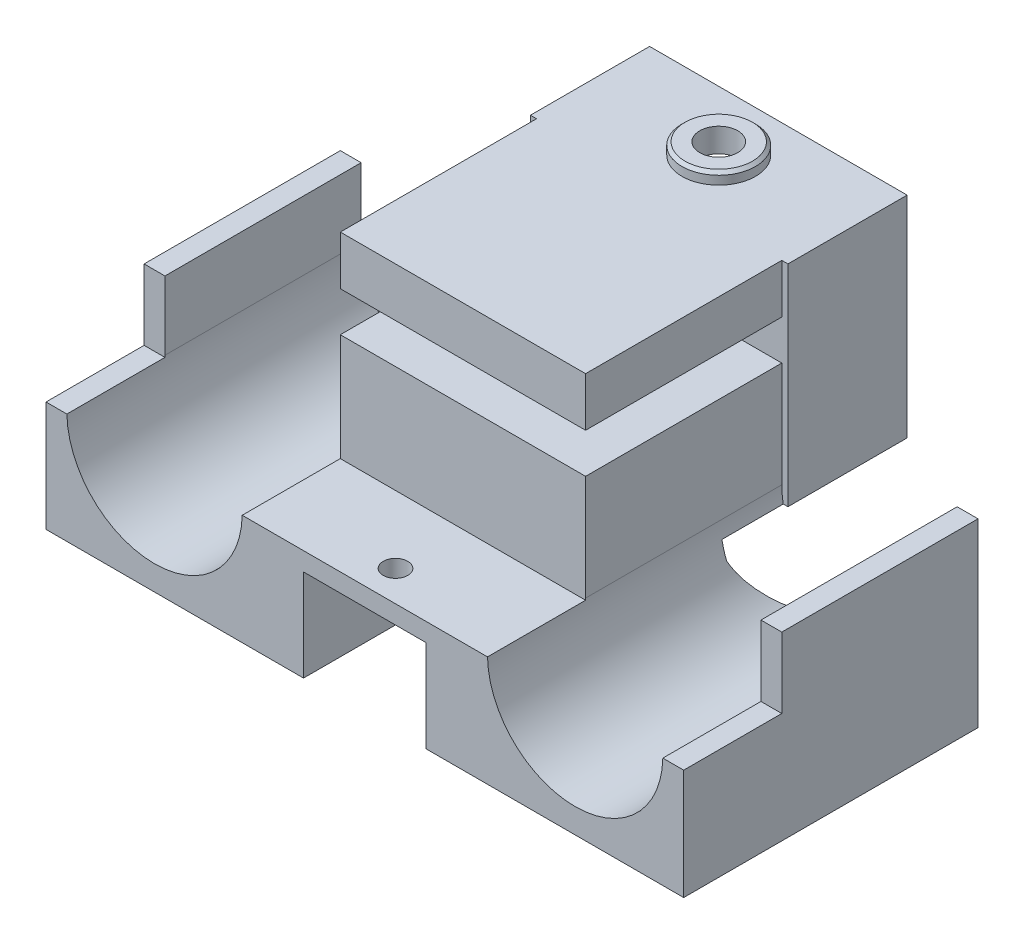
ISO-10303-21;
HEADER;
FILE_DESCRIPTION(('STEP AP214'),'2;1');
FILE_NAME('part.step','',(''),(''),'','','');
FILE_SCHEMA(('AUTOMOTIVE_DESIGN { 1 0 10303 214 1 1 1 1 }'));
ENDSEC;
DATA;
#1=APPLICATION_CONTEXT('core data for automotive mechanical design processes');
#2=APPLICATION_PROTOCOL_DEFINITION('international standard','automotive_design',2000,#1);
#3=PRODUCT_CONTEXT('',#1,'mechanical');
#4=PRODUCT('Part','Part','',(#3));
#5=PRODUCT_RELATED_PRODUCT_CATEGORY('part','',(#4));
#6=PRODUCT_DEFINITION_FORMATION('','',#4);
#7=PRODUCT_DEFINITION_CONTEXT('part definition',#1,'design');
#8=PRODUCT_DEFINITION('design','',#6,#7);
#9=PRODUCT_DEFINITION_SHAPE('','',#8);
#10=(LENGTH_UNIT() NAMED_UNIT(*) SI_UNIT(.MILLI.,.METRE.));
#11=(NAMED_UNIT(*) PLANE_ANGLE_UNIT() SI_UNIT($,.RADIAN.));
#12=(NAMED_UNIT(*) SI_UNIT($,.STERADIAN.) SOLID_ANGLE_UNIT());
#13=UNCERTAINTY_MEASURE_WITH_UNIT(LENGTH_MEASURE(1.E-05),#10,'distance_accuracy_value','');
#14=(GEOMETRIC_REPRESENTATION_CONTEXT(3) GLOBAL_UNCERTAINTY_ASSIGNED_CONTEXT((#13)) GLOBAL_UNIT_ASSIGNED_CONTEXT((#10,
#11,#12)) REPRESENTATION_CONTEXT('',''));
#15=CARTESIAN_POINT('',(0.,0.,0.));
#16=DIRECTION('',(0.,0.,1.));
#17=DIRECTION('',(1.,0.,0.));
#18=AXIS2_PLACEMENT_3D('',#15,#16,#17);
#19=CARTESIAN_POINT('',(5.,0.,0.));
#20=DIRECTION('',(1.,0.,0.));
#21=DIRECTION('',(0.,0.,-1.));
#22=AXIS2_PLACEMENT_3D('',#19,#20,#21);
#23=PLANE('',#22);
#24=DIRECTION('',(0.,0.,-1.));
#25=VECTOR('',#24,1.);
#26=CARTESIAN_POINT('',(5.,-8.925,0.));
#27=LINE('',#26,#25);
#28=CARTESIAN_POINT('',(5.,-8.925,28.86));
#29=VERTEX_POINT('',#28);
#30=CARTESIAN_POINT('',(5.,-8.925,19.36));
#31=VERTEX_POINT('',#30);
#32=EDGE_CURVE('E563',#29,#31,#27,.T.);
#33=ORIENTED_EDGE('',*,*,#32,.T.);
#34=DIRECTION('',(0.,-1.,0.));
#35=VECTOR('',#34,1.);
#36=CARTESIAN_POINT('',(5.,0.,19.36));
#37=LINE('',#36,#35);
#38=CARTESIAN_POINT('',(5.,-16.425,19.36));
#39=VERTEX_POINT('',#38);
#40=EDGE_CURVE('E809',#31,#39,#37,.T.);
#41=ORIENTED_EDGE('',*,*,#40,.T.);
#42=DIRECTION('',(0.,0.,1.));
#43=VECTOR('',#42,1.);
#44=CARTESIAN_POINT('',(5.,-16.425,0.));
#45=LINE('',#44,#43);
#46=CARTESIAN_POINT('',(5.,-16.425,28.86));
#47=VERTEX_POINT('',#46);
#48=EDGE_CURVE('E520',#39,#47,#45,.T.);
#49=ORIENTED_EDGE('',*,*,#48,.T.);
#50=DIRECTION('',(0.,-1.,0.));
#51=VECTOR('',#50,1.);
#52=CARTESIAN_POINT('',(5.,0.,28.86));
#53=LINE('',#52,#51);
#54=EDGE_CURVE('E516',#29,#47,#53,.T.);
#55=ORIENTED_EDGE('',*,*,#54,.F.);
#56=EDGE_LOOP('',(#33,#41,#49,#55));
#57=FACE_BOUND('',#56,.T.);
#58=ADVANCED_FACE('F53',(#57),#23,.F.);
#59=CARTESIAN_POINT('',(-5.,0.,0.));
#60=DIRECTION('',(1.,0.,0.));
#61=DIRECTION('',(0.,0.,-1.));
#62=AXIS2_PLACEMENT_3D('',#59,#60,#61);
#63=PLANE('',#62);
#64=DIRECTION('',(0.,1.,0.));
#65=VECTOR('',#64,1.);
#66=CARTESIAN_POINT('',(-5.,0.,19.36));
#67=LINE('',#66,#65);
#68=CARTESIAN_POINT('',(-5.,-16.425,19.36));
#69=VERTEX_POINT('',#68);
#70=CARTESIAN_POINT('',(-5.,-8.925,19.36));
#71=VERTEX_POINT('',#70);
#72=EDGE_CURVE('E330',#69,#71,#67,.T.);
#73=ORIENTED_EDGE('',*,*,#72,.T.);
#74=DIRECTION('',(0.,0.,-1.));
#75=VECTOR('',#74,1.);
#76=CARTESIAN_POINT('',(-5.,-8.925,0.));
#77=LINE('',#76,#75);
#78=CARTESIAN_POINT('',(-5.,-8.925,28.86));
#79=VERTEX_POINT('',#78);
#80=EDGE_CURVE('E567',#79,#71,#77,.T.);
#81=ORIENTED_EDGE('',*,*,#80,.F.);
#82=DIRECTION('',(0.,-1.,0.));
#83=VECTOR('',#82,1.);
#84=CARTESIAN_POINT('',(-5.,0.,28.86));
#85=LINE('',#84,#83);
#86=CARTESIAN_POINT('',(-5.,-16.425,28.86));
#87=VERTEX_POINT('',#86);
#88=EDGE_CURVE('E479',#79,#87,#85,.T.);
#89=ORIENTED_EDGE('',*,*,#88,.T.);
#90=DIRECTION('',(0.,0.,-1.));
#91=VECTOR('',#90,1.);
#92=CARTESIAN_POINT('',(-5.,-16.425,0.));
#93=LINE('',#92,#91);
#94=EDGE_CURVE('E69',#87,#69,#93,.T.);
#95=ORIENTED_EDGE('',*,*,#94,.T.);
#96=EDGE_LOOP('',(#73,#81,#89,#95));
#97=FACE_BOUND('',#96,.T.);
#98=ADVANCED_FACE('F819',(#97),#63,.T.);
#99=CARTESIAN_POINT('',(23.170241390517,0.,4.86));
#100=DIRECTION('',(0.,0.,1.));
#101=DIRECTION('',(1.,0.,0.));
#102=AXIS2_PLACEMENT_3D('',#99,#100,#101);
#103=PLANE('',#102);
#104=CARTESIAN_POINT('',(-17.15,-7.275,4.86));
#105=DIRECTION('',(0.,0.,-1.));
#106=DIRECTION('',(-1.,0.,0.));
#107=AXIS2_PLACEMENT_3D('',#104,#105,#106);
#108=CIRCLE('',#107,7.15);
#109=CARTESIAN_POINT('',(-24.3,-7.275,4.86));
#110=VERTEX_POINT('',#109);
#111=CARTESIAN_POINT('',(-15.5000000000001,-14.2320108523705,4.86));
#112=VERTEX_POINT('',#111);
#113=EDGE_CURVE('E364',#110,#112,#108,.F.);
#114=ORIENTED_EDGE('',*,*,#113,.T.);
#115=DIRECTION('',(0.,-1.,0.));
#116=VECTOR('',#115,1.);
#117=CARTESIAN_POINT('',(-15.5000000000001,-16.425,4.86));
#118=LINE('',#117,#116);
#119=CARTESIAN_POINT('',(-15.5000000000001,-16.425,4.86));
#120=VERTEX_POINT('',#119);
#121=EDGE_CURVE('E767',#112,#120,#118,.T.);
#122=ORIENTED_EDGE('',*,*,#121,.T.);
#123=DIRECTION('',(-1.,0.,0.));
#124=VECTOR('',#123,1.);
#125=CARTESIAN_POINT('',(23.170241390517,-16.425,4.86));
#126=LINE('',#125,#124);
#127=CARTESIAN_POINT('',(-26.,-16.425,4.86));
#128=VERTEX_POINT('',#127);
#129=EDGE_CURVE('E490',#120,#128,#126,.T.);
#130=ORIENTED_EDGE('',*,*,#129,.T.);
#131=DIRECTION('',(0.,1.,0.));
#132=VECTOR('',#131,1.);
#133=CARTESIAN_POINT('',(-26.,0.,4.86));
#134=LINE('',#133,#132);
#135=CARTESIAN_POINT('',(-26.,-1.675,4.86));
#136=VERTEX_POINT('',#135);
#137=EDGE_CURVE('E486',#128,#136,#134,.T.);
#138=ORIENTED_EDGE('',*,*,#137,.T.);
#139=DIRECTION('',(-1.,0.,0.));
#140=VECTOR('',#139,1.);
#141=CARTESIAN_POINT('',(23.170241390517,-1.675,4.86));
#142=LINE('',#141,#140);
#143=CARTESIAN_POINT('',(-24.3,-1.675,4.86));
#144=VERTEX_POINT('',#143);
#145=EDGE_CURVE('E485',#144,#136,#142,.T.);
#146=ORIENTED_EDGE('',*,*,#145,.F.);
#147=DIRECTION('',(0.,1.,0.));
#148=VECTOR('',#147,1.);
#149=CARTESIAN_POINT('',(-24.3,0.,4.86));
#150=LINE('',#149,#148);
#151=EDGE_CURVE('E359',#110,#144,#150,.T.);
#152=ORIENTED_EDGE('',*,*,#151,.F.);
#153=EDGE_LOOP('',(#114,#122,#130,#138,#146,#152));
#154=FACE_BOUND('',#153,.T.);
#155=ADVANCED_FACE('F835',(#154),#103,.F.);
#156=CARTESIAN_POINT('',(-17.15,-7.275,-22.2230205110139));
#157=DIRECTION('',(0.,0.,1.));
#158=DIRECTION('',(1.,0.,0.));
#159=AXIS2_PLACEMENT_3D('',#156,#157,#158);
#160=CYLINDRICAL_SURFACE('',#159,7.15);
#161=CARTESIAN_POINT('',(-17.15,-7.275,9.86));
#162=DIRECTION('',(0.,0.,-1.));
#163=DIRECTION('',(-1.,0.,0.));
#164=AXIS2_PLACEMENT_3D('',#161,#162,#163);
#165=CIRCLE('',#164,7.15);
#166=CARTESIAN_POINT('',(-10.5,-9.90178510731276,9.86));
#167=VERTEX_POINT('',#166);
#168=CARTESIAN_POINT('',(-10.1191750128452,-8.575,9.86));
#169=VERTEX_POINT('',#168);
#170=EDGE_CURVE('E347',#167,#169,#165,.F.);
#171=ORIENTED_EDGE('',*,*,#170,.F.);
#172=CARTESIAN_POINT('',(-17.15,-7.275,3.21000000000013));
#173=DIRECTION('',(0.707106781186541,0.,-0.707106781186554));
#174=DIRECTION('',(0.707106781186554,0.,0.707106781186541));
#175=AXIS2_PLACEMENT_3D('',#172,#173,#174);
#176=ELLIPSE('',#175,10.1116269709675,7.15);
#177=EDGE_CURVE('E320',#167,#112,#176,.T.);
#178=ORIENTED_EDGE('',*,*,#177,.T.);
#179=ORIENTED_EDGE('',*,*,#113,.F.);
#180=DIRECTION('',(0.,0.,1.));
#181=VECTOR('',#180,1.);
#182=CARTESIAN_POINT('',(-24.3,-7.275,-22.2230205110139));
#183=LINE('',#182,#181);
#184=CARTESIAN_POINT('',(-24.3,-7.275,20.86));
#185=VERTEX_POINT('',#184);
#186=EDGE_CURVE('E384',#110,#185,#183,.T.);
#187=ORIENTED_EDGE('',*,*,#186,.T.);
#188=CARTESIAN_POINT('',(-17.15,-7.275,20.86));
#189=DIRECTION('',(0.,0.,1.));
#190=DIRECTION('',(1.,0.,0.));
#191=AXIS2_PLACEMENT_3D('',#188,#189,#190);
#192=CIRCLE('',#191,7.15);
#193=CARTESIAN_POINT('',(-24.2984264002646,-7.42499999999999,20.86));
#194=VERTEX_POINT('',#193);
#195=EDGE_CURVE('E428',#185,#194,#192,.T.);
#196=ORIENTED_EDGE('',*,*,#195,.T.);
#197=DIRECTION('',(0.,0.,1.));
#198=VECTOR('',#197,1.);
#199=CARTESIAN_POINT('',(-24.2984264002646,-7.42499999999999,-22.2230205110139));
#200=LINE('',#199,#198);
#201=CARTESIAN_POINT('',(-24.2984264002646,-7.425,28.86));
#202=VERTEX_POINT('',#201);
#203=EDGE_CURVE('E424',#202,#194,#200,.F.);
#204=ORIENTED_EDGE('',*,*,#203,.F.);
#205=CARTESIAN_POINT('',(-17.15,-7.275,28.86));
#206=DIRECTION('',(0.,0.,1.));
#207=DIRECTION('',(1.,0.,0.));
#208=AXIS2_PLACEMENT_3D('',#205,#206,#207);
#209=CIRCLE('',#208,7.15);
#210=CARTESIAN_POINT('',(-10.0015735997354,-7.425,28.86));
#211=VERTEX_POINT('',#210);
#212=EDGE_CURVE('E354',#202,#211,#209,.T.);
#213=ORIENTED_EDGE('',*,*,#212,.T.);
#214=DIRECTION('',(0.,0.,1.));
#215=VECTOR('',#214,1.);
#216=CARTESIAN_POINT('',(-10.0015735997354,-7.42499999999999,-22.2230205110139));
#217=LINE('',#216,#215);
#218=CARTESIAN_POINT('',(-10.0015735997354,-7.42499999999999,20.86));
#219=VERTEX_POINT('',#218);
#220=EDGE_CURVE('E431',#219,#211,#217,.T.);
#221=ORIENTED_EDGE('',*,*,#220,.F.);
#222=CARTESIAN_POINT('',(-10.,-7.275,20.86));
#223=VERTEX_POINT('',#222);
#224=EDGE_CURVE('E432',#219,#223,#192,.T.);
#225=ORIENTED_EDGE('',*,*,#224,.T.);
#226=DIRECTION('',(0.,0.,1.));
#227=VECTOR('',#226,1.);
#228=CARTESIAN_POINT('',(-10.,-7.275,-22.2230205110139));
#229=LINE('',#228,#227);
#230=CARTESIAN_POINT('',(-10.,-7.275,4.86));
#231=VERTEX_POINT('',#230);
#232=EDGE_CURVE('E368',#231,#223,#229,.T.);
#233=ORIENTED_EDGE('',*,*,#232,.F.);
#234=CARTESIAN_POINT('',(-10.1191750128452,-8.575,4.86));
#235=VERTEX_POINT('',#234);
#236=EDGE_CURVE('E369',#235,#231,#108,.F.);
#237=ORIENTED_EDGE('',*,*,#236,.F.);
#238=DIRECTION('',(0.,0.,1.));
#239=VECTOR('',#238,1.);
#240=CARTESIAN_POINT('',(-10.1191750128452,-8.575,-22.2230205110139));
#241=LINE('',#240,#239);
#242=EDGE_CURVE('E350',#169,#235,#241,.F.);
#243=ORIENTED_EDGE('',*,*,#242,.F.);
#244=EDGE_LOOP('',(#171,#178,#179,#187,#196,#204,#213,#221,#225,#233,#237,#243));
#245=FACE_BOUND('',#244,.T.);
#246=ADVANCED_FACE('F945',(#245),#160,.F.);
#247=CARTESIAN_POINT('',(0.,8.575,0.));
#248=DIRECTION('',(0.,1.,0.));
#249=DIRECTION('',(0.,0.,1.));
#250=AXIS2_PLACEMENT_3D('',#247,#248,#249);
#251=PLANE('',#250);
#252=CARTESIAN_POINT('',(0.,8.575,0.));
#253=DIRECTION('',(0.,1.,0.));
#254=DIRECTION('',(0.,0.,1.));
#255=AXIS2_PLACEMENT_3D('',#252,#253,#254);
#256=CIRCLE('',#255,3.);
#257=CARTESIAN_POINT('',(0.,8.575,-3.));
#258=VERTEX_POINT('',#257);
#259=EDGE_CURVE('E681',#258,#258,#256,.T.);
#260=ORIENTED_EDGE('',*,*,#259,.F.);
#261=EDGE_LOOP('',(#260));
#262=FACE_BOUND('',#261,.T.);
#263=DIRECTION('',(-1.,0.,0.));
#264=VECTOR('',#263,1.);
#265=CARTESIAN_POINT('',(0.,8.575,4.86));
#266=LINE('',#265,#264);
#267=CARTESIAN_POINT('',(-10.,8.575,4.86));
#268=VERTEX_POINT('',#267);
#269=CARTESIAN_POINT('',(-10.5,8.575,4.86));
#270=VERTEX_POINT('',#269);
#271=EDGE_CURVE('E372',#268,#270,#266,.T.);
#272=ORIENTED_EDGE('',*,*,#271,.F.);
#273=DIRECTION('',(0.,0.,1.));
#274=VECTOR('',#273,1.);
#275=CARTESIAN_POINT('',(-10.,8.575,-22.2230205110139));
#276=LINE('',#275,#274);
#277=CARTESIAN_POINT('',(-10.,8.575,20.86));
#278=VERTEX_POINT('',#277);
#279=EDGE_CURVE('E376',#268,#278,#276,.T.);
#280=ORIENTED_EDGE('',*,*,#279,.T.);
#281=DIRECTION('',(-1.,0.,0.));
#282=VECTOR('',#281,1.);
#283=CARTESIAN_POINT('',(0.,8.575,20.86));
#284=LINE('',#283,#282);
#285=CARTESIAN_POINT('',(10.,8.575,20.86));
#286=VERTEX_POINT('',#285);
#287=EDGE_CURVE('E590',#286,#278,#284,.T.);
#288=ORIENTED_EDGE('',*,*,#287,.F.);
#289=DIRECTION('',(0.,0.,1.));
#290=VECTOR('',#289,1.);
#291=CARTESIAN_POINT('',(10.,8.575,-22.2230205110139));
#292=LINE('',#291,#290);
#293=CARTESIAN_POINT('',(10.,8.575,4.86));
#294=VERTEX_POINT('',#293);
#295=EDGE_CURVE('E408',#294,#286,#292,.T.);
#296=ORIENTED_EDGE('',*,*,#295,.F.);
#297=DIRECTION('',(1.,0.,0.));
#298=VECTOR('',#297,1.);
#299=CARTESIAN_POINT('',(0.,8.57500000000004,4.86));
#300=LINE('',#299,#298);
#301=CARTESIAN_POINT('',(10.5,8.575,4.86));
#302=VERTEX_POINT('',#301);
#303=EDGE_CURVE('E402',#294,#302,#300,.T.);
#304=ORIENTED_EDGE('',*,*,#303,.T.);
#305=DIRECTION('',(0.,0.,-1.));
#306=VECTOR('',#305,1.);
#307=CARTESIAN_POINT('',(10.5,8.575,4.86));
#308=LINE('',#307,#306);
#309=CARTESIAN_POINT('',(10.5,8.575,-4.86));
#310=VERTEX_POINT('',#309);
#311=EDGE_CURVE('E687',#302,#310,#308,.T.);
#312=ORIENTED_EDGE('',*,*,#311,.T.);
#313=DIRECTION('',(1.,0.,0.));
#314=VECTOR('',#313,1.);
#315=CARTESIAN_POINT('',(-10.5,8.575,-4.86));
#316=LINE('',#315,#314);
#317=CARTESIAN_POINT('',(-10.5,8.575,-4.86));
#318=VERTEX_POINT('',#317);
#319=EDGE_CURVE('E690',#318,#310,#316,.T.);
#320=ORIENTED_EDGE('',*,*,#319,.F.);
#321=DIRECTION('',(0.,0.,-1.));
#322=VECTOR('',#321,1.);
#323=CARTESIAN_POINT('',(-10.5,8.575,4.86));
#324=LINE('',#323,#322);
#325=EDGE_CURVE('E695',#270,#318,#324,.T.);
#326=ORIENTED_EDGE('',*,*,#325,.F.);
#327=EDGE_LOOP('',(#272,#280,#288,#296,#304,#312,#320,#326));
#328=FACE_BOUND('',#327,.T.);
#329=ADVANCED_FACE('F881',(#262,#328),#251,.T.);
#330=CARTESIAN_POINT('',(0.,1.325,20.86));
#331=DIRECTION('',(0.,1.,0.));
#332=DIRECTION('',(0.,0.,1.));
#333=AXIS2_PLACEMENT_3D('',#330,#331,#332);
#334=PLANE('',#333);
#335=DIRECTION('',(1.,0.,0.));
#336=VECTOR('',#335,1.);
#337=CARTESIAN_POINT('',(0.,1.325,4.86));
#338=LINE('',#337,#336);
#339=CARTESIAN_POINT('',(-10.,1.325,4.86));
#340=VERTEX_POINT('',#339);
#341=CARTESIAN_POINT('',(10.,1.325,4.86));
#342=VERTEX_POINT('',#341);
#343=EDGE_CURVE('E594',#340,#342,#338,.T.);
#344=ORIENTED_EDGE('',*,*,#343,.F.);
#345=DIRECTION('',(0.,0.,1.));
#346=VECTOR('',#345,1.);
#347=CARTESIAN_POINT('',(-10.,1.325,20.86));
#348=LINE('',#347,#346);
#349=CARTESIAN_POINT('',(-10.,1.325,20.86));
#350=VERTEX_POINT('',#349);
#351=EDGE_CURVE('E470',#340,#350,#348,.T.);
#352=ORIENTED_EDGE('',*,*,#351,.T.);
#353=DIRECTION('',(1.,0.,0.));
#354=VECTOR('',#353,1.);
#355=CARTESIAN_POINT('',(0.,1.325,20.86));
#356=LINE('',#355,#354);
#357=CARTESIAN_POINT('',(10.,1.325,20.86));
#358=VERTEX_POINT('',#357);
#359=EDGE_CURVE('E598',#350,#358,#356,.T.);
#360=ORIENTED_EDGE('',*,*,#359,.T.);
#361=DIRECTION('',(0.,0.,-1.));
#362=VECTOR('',#361,1.);
#363=CARTESIAN_POINT('',(10.,1.325,20.86));
#364=LINE('',#363,#362);
#365=EDGE_CURVE('E459',#358,#342,#364,.T.);
#366=ORIENTED_EDGE('',*,*,#365,.T.);
#367=EDGE_LOOP('',(#344,#352,#360,#366));
#368=FACE_BOUND('',#367,.T.);
#369=ADVANCED_FACE('F878',(#368),#334,.T.);
#370=CARTESIAN_POINT('',(0.,0.,20.86));
#371=DIRECTION('',(0.,0.,1.));
#372=DIRECTION('',(1.,0.,0.));
#373=AXIS2_PLACEMENT_3D('',#370,#371,#372);
#374=PLANE('',#373);
#375=ORIENTED_EDGE('',*,*,#359,.F.);
#376=DIRECTION('',(0.,-1.,0.));
#377=VECTOR('',#376,1.);
#378=CARTESIAN_POINT('',(-10.,0.,20.86));
#379=LINE('',#378,#377);
#380=EDGE_CURVE('E466',#350,#223,#379,.T.);
#381=ORIENTED_EDGE('',*,*,#380,.T.);
#382=ORIENTED_EDGE('',*,*,#224,.F.);
#383=DIRECTION('',(-1.,0.,0.));
#384=VECTOR('',#383,1.);
#385=CARTESIAN_POINT('',(5.,-7.425,20.86));
#386=LINE('',#385,#384);
#387=CARTESIAN_POINT('',(10.0015735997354,-7.42499999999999,20.86));
#388=VERTEX_POINT('',#387);
#389=EDGE_CURVE('E585',#388,#219,#386,.T.);
#390=ORIENTED_EDGE('',*,*,#389,.F.);
#391=CARTESIAN_POINT('',(17.15,-7.275,20.86));
#392=DIRECTION('',(0.,0.,1.));
#393=DIRECTION('',(1.,0.,0.));
#394=AXIS2_PLACEMENT_3D('',#391,#392,#393);
#395=CIRCLE('',#394,7.15);
#396=CARTESIAN_POINT('',(10.,-7.275,20.86));
#397=VERTEX_POINT('',#396);
#398=EDGE_CURVE('E444',#397,#388,#395,.T.);
#399=ORIENTED_EDGE('',*,*,#398,.F.);
#400=DIRECTION('',(0.,1.,0.));
#401=VECTOR('',#400,1.);
#402=CARTESIAN_POINT('',(10.,0.,20.86));
#403=LINE('',#402,#401);
#404=EDGE_CURVE('E455',#397,#358,#403,.T.);
#405=ORIENTED_EDGE('',*,*,#404,.T.);
#406=EDGE_LOOP('',(#375,#381,#382,#390,#399,#405));
#407=FACE_BOUND('',#406,.T.);
#408=ADVANCED_FACE('F877',(#407),#374,.T.);
#409=CARTESIAN_POINT('',(24.2984264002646,-7.42499999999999,20.86));
#410=VERTEX_POINT('',#409);
#411=CARTESIAN_POINT('',(24.3,-7.275,20.86));
#412=VERTEX_POINT('',#411);
#413=EDGE_CURVE('E448',#410,#412,#395,.T.);
#414=ORIENTED_EDGE('',*,*,#413,.F.);
#415=CARTESIAN_POINT('',(26.,-7.425,20.86));
#416=VERTEX_POINT('',#415);
#417=EDGE_CURVE('E580',#416,#410,#386,.T.);
#418=ORIENTED_EDGE('',*,*,#417,.F.);
#419=DIRECTION('',(0.,-1.,0.));
#420=VECTOR('',#419,1.);
#421=CARTESIAN_POINT('',(26.,0.,20.86));
#422=LINE('',#421,#420);
#423=CARTESIAN_POINT('',(26.,-1.675,20.86));
#424=VERTEX_POINT('',#423);
#425=EDGE_CURVE('E505',#424,#416,#422,.T.);
#426=ORIENTED_EDGE('',*,*,#425,.F.);
#427=DIRECTION('',(1.,0.,0.));
#428=VECTOR('',#427,1.);
#429=CARTESIAN_POINT('',(-23.170241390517,-1.675,20.86));
#430=LINE('',#429,#428);
#431=CARTESIAN_POINT('',(24.3,-1.675,20.86));
#432=VERTEX_POINT('',#431);
#433=EDGE_CURVE('E521',#432,#424,#430,.T.);
#434=ORIENTED_EDGE('',*,*,#433,.F.);
#435=DIRECTION('',(0.,-1.,0.));
#436=VECTOR('',#435,1.);
#437=CARTESIAN_POINT('',(24.3,0.,20.86));
#438=LINE('',#437,#436);
#439=EDGE_CURVE('E436',#432,#412,#438,.T.);
#440=ORIENTED_EDGE('',*,*,#439,.T.);
#441=EDGE_LOOP('',(#414,#418,#426,#434,#440));
#442=FACE_BOUND('',#441,.T.);
#443=ADVANCED_FACE('F788',(#442),#374,.T.);
#444=CARTESIAN_POINT('',(0.,4.575,20.86));
#445=DIRECTION('',(0.,1.,0.));
#446=DIRECTION('',(0.,0.,1.));
#447=AXIS2_PLACEMENT_3D('',#444,#445,#446);
#448=PLANE('',#447);
#449=DIRECTION('',(0.,0.,1.));
#450=VECTOR('',#449,1.);
#451=CARTESIAN_POINT('',(-10.,4.575,20.86));
#452=LINE('',#451,#450);
#453=CARTESIAN_POINT('',(-10.,4.575,4.86));
#454=VERTEX_POINT('',#453);
#455=CARTESIAN_POINT('',(-9.99999999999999,4.575,20.86));
#456=VERTEX_POINT('',#455);
#457=EDGE_CURVE('E463',#454,#456,#452,.T.);
#458=ORIENTED_EDGE('',*,*,#457,.F.);
#459=DIRECTION('',(1.,0.,0.));
#460=VECTOR('',#459,1.);
#461=CARTESIAN_POINT('',(0.,4.575,4.86));
#462=LINE('',#461,#460);
#463=CARTESIAN_POINT('',(10.,4.575,4.86));
#464=VERTEX_POINT('',#463);
#465=EDGE_CURVE('E584',#454,#464,#462,.T.);
#466=ORIENTED_EDGE('',*,*,#465,.T.);
#467=DIRECTION('',(0.,0.,-1.));
#468=VECTOR('',#467,1.);
#469=CARTESIAN_POINT('',(10.,4.575,20.86));
#470=LINE('',#469,#468);
#471=CARTESIAN_POINT('',(10.,4.575,20.86));
#472=VERTEX_POINT('',#471);
#473=EDGE_CURVE('E452',#472,#464,#470,.T.);
#474=ORIENTED_EDGE('',*,*,#473,.F.);
#475=DIRECTION('',(1.,0.,0.));
#476=VECTOR('',#475,1.);
#477=CARTESIAN_POINT('',(0.,4.575,20.86));
#478=LINE('',#477,#476);
#479=EDGE_CURVE('E586',#456,#472,#478,.T.);
#480=ORIENTED_EDGE('',*,*,#479,.F.);
#481=EDGE_LOOP('',(#458,#466,#474,#480));
#482=FACE_BOUND('',#481,.T.);
#483=ADVANCED_FACE('F868',(#482),#448,.F.);
#484=CARTESIAN_POINT('',(0.,0.,20.86));
#485=DIRECTION('',(0.,0.,1.));
#486=DIRECTION('',(1.,0.,0.));
#487=AXIS2_PLACEMENT_3D('',#484,#485,#486);
#488=PLANE('',#487);
#489=ORIENTED_EDGE('',*,*,#287,.T.);
#490=DIRECTION('',(0.,-1.,0.));
#491=VECTOR('',#490,1.);
#492=CARTESIAN_POINT('',(-10.,0.,20.86));
#493=LINE('',#492,#491);
#494=EDGE_CURVE('E757',#278,#456,#493,.T.);
#495=ORIENTED_EDGE('',*,*,#494,.T.);
#496=ORIENTED_EDGE('',*,*,#479,.T.);
#497=DIRECTION('',(0.,1.,0.));
#498=VECTOR('',#497,1.);
#499=CARTESIAN_POINT('',(10.,0.,20.86));
#500=LINE('',#499,#498);
#501=EDGE_CURVE('E753',#472,#286,#500,.T.);
#502=ORIENTED_EDGE('',*,*,#501,.T.);
#503=EDGE_LOOP('',(#489,#495,#496,#502));
#504=FACE_BOUND('',#503,.T.);
#505=ADVANCED_FACE('F865',(#504),#488,.T.);
#506=CARTESIAN_POINT('',(5.,-7.425,0.));
#507=DIRECTION('',(0.,-1.,0.));
#508=DIRECTION('',(0.,0.,-1.));
#509=AXIS2_PLACEMENT_3D('',#506,#507,#508);
#510=PLANE('',#509);
#511=CARTESIAN_POINT('',(0.,-7.42500000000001,26.36));
#512=DIRECTION('',(0.,-1.,0.));
#513=DIRECTION('',(0.,0.,-1.));
#514=AXIS2_PLACEMENT_3D('',#511,#512,#513);
#515=CIRCLE('',#514,1.);
#516=CARTESIAN_POINT('',(0.,-7.42500000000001,25.36));
#517=VERTEX_POINT('',#516);
#518=EDGE_CURVE('E562',#517,#517,#515,.T.);
#519=ORIENTED_EDGE('',*,*,#518,.T.);
#520=EDGE_LOOP('',(#519));
#521=FACE_BOUND('',#520,.T.);
#522=ORIENTED_EDGE('',*,*,#389,.T.);
#523=ORIENTED_EDGE('',*,*,#220,.T.);
#524=DIRECTION('',(-1.,0.,0.));
#525=VECTOR('',#524,1.);
#526=CARTESIAN_POINT('',(5.,-7.425,28.86));
#527=LINE('',#526,#525);
#528=CARTESIAN_POINT('',(10.0015735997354,-7.425,28.86));
#529=VERTEX_POINT('',#528);
#530=EDGE_CURVE('E579',#529,#211,#527,.T.);
#531=ORIENTED_EDGE('',*,*,#530,.F.);
#532=DIRECTION('',(0.,0.,1.));
#533=VECTOR('',#532,1.);
#534=CARTESIAN_POINT('',(10.0015735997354,-7.42499999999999,-22.2230205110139));
#535=LINE('',#534,#533);
#536=EDGE_CURVE('E440',#529,#388,#535,.F.);
#537=ORIENTED_EDGE('',*,*,#536,.T.);
#538=EDGE_LOOP('',(#522,#523,#531,#537));
#539=FACE_BOUND('',#538,.T.);
#540=ADVANCED_FACE('F860',(#521,#539),#510,.F.);
#541=ORIENTED_EDGE('',*,*,#417,.T.);
#542=DIRECTION('',(0.,0.,1.));
#543=VECTOR('',#542,1.);
#544=CARTESIAN_POINT('',(24.2984264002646,-7.42499999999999,-22.2230205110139));
#545=LINE('',#544,#543);
#546=CARTESIAN_POINT('',(24.2984264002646,-7.425,28.86));
#547=VERTEX_POINT('',#546);
#548=EDGE_CURVE('E447',#410,#547,#545,.T.);
#549=ORIENTED_EDGE('',*,*,#548,.T.);
#550=CARTESIAN_POINT('',(26.,-7.425,28.86));
#551=VERTEX_POINT('',#550);
#552=EDGE_CURVE('E574',#551,#547,#527,.T.);
#553=ORIENTED_EDGE('',*,*,#552,.F.);
#554=DIRECTION('',(0.,0.,1.));
#555=VECTOR('',#554,1.);
#556=CARTESIAN_POINT('',(26.,-7.425,0.));
#557=LINE('',#556,#555);
#558=EDGE_CURVE('E528',#416,#551,#557,.T.);
#559=ORIENTED_EDGE('',*,*,#558,.F.);
#560=EDGE_LOOP('',(#541,#549,#553,#559));
#561=FACE_BOUND('',#560,.T.);
#562=ADVANCED_FACE('F845',(#561),#510,.F.);
#563=CARTESIAN_POINT('',(-23.170241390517,-1.675,0.));
#564=DIRECTION('',(0.,-1.,0.));
#565=DIRECTION('',(0.,0.,-1.));
#566=AXIS2_PLACEMENT_3D('',#563,#564,#565);
#567=PLANE('',#566);
#568=DIRECTION('',(0.,0.,1.));
#569=VECTOR('',#568,1.);
#570=CARTESIAN_POINT('',(24.3,-1.675,-22.2230205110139));
#571=LINE('',#570,#569);
#572=CARTESIAN_POINT('',(24.3,-1.675,4.86));
#573=VERTEX_POINT('',#572);
#574=EDGE_CURVE('E411',#573,#432,#571,.T.);
#575=ORIENTED_EDGE('',*,*,#574,.T.);
#576=ORIENTED_EDGE('',*,*,#433,.T.);
#577=DIRECTION('',(0.,0.,-1.));
#578=VECTOR('',#577,1.);
#579=CARTESIAN_POINT('',(26.,-1.675,0.));
#580=LINE('',#579,#578);
#581=CARTESIAN_POINT('',(26.,-1.675,4.86));
#582=VERTEX_POINT('',#581);
#583=EDGE_CURVE('E544',#424,#582,#580,.T.);
#584=ORIENTED_EDGE('',*,*,#583,.T.);
#585=DIRECTION('',(1.,0.,0.));
#586=VECTOR('',#585,1.);
#587=CARTESIAN_POINT('',(-23.170241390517,-1.675,4.86));
#588=LINE('',#587,#586);
#589=EDGE_CURVE('E551',#573,#582,#588,.T.);
#590=ORIENTED_EDGE('',*,*,#589,.F.);
#591=EDGE_LOOP('',(#575,#576,#584,#590));
#592=FACE_BOUND('',#591,.T.);
#593=ADVANCED_FACE('F792',(#592),#567,.F.);
#594=CARTESIAN_POINT('',(23.170241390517,-1.675,0.));
#595=DIRECTION('',(0.,-1.,0.));
#596=DIRECTION('',(0.,0.,-1.));
#597=AXIS2_PLACEMENT_3D('',#594,#595,#596);
#598=PLANE('',#597);
#599=DIRECTION('',(0.,0.,1.));
#600=VECTOR('',#599,1.);
#601=CARTESIAN_POINT('',(-24.3,-1.675,-22.2230205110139));
#602=LINE('',#601,#600);
#603=CARTESIAN_POINT('',(-24.3,-1.675,20.86));
#604=VERTEX_POINT('',#603);
#605=EDGE_CURVE('E358',#144,#604,#602,.T.);
#606=ORIENTED_EDGE('',*,*,#605,.F.);
#607=ORIENTED_EDGE('',*,*,#145,.T.);
#608=DIRECTION('',(0.,0.,1.));
#609=VECTOR('',#608,1.);
#610=CARTESIAN_POINT('',(-26.,-1.675,0.));
#611=LINE('',#610,#609);
#612=CARTESIAN_POINT('',(-26.,-1.675,20.86));
#613=VERTEX_POINT('',#612);
#614=EDGE_CURVE('E481',#136,#613,#611,.T.);
#615=ORIENTED_EDGE('',*,*,#614,.T.);
#616=DIRECTION('',(-1.,0.,0.));
#617=VECTOR('',#616,1.);
#618=CARTESIAN_POINT('',(23.170241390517,-1.675,20.86));
#619=LINE('',#618,#617);
#620=EDGE_CURVE('E480',#604,#613,#619,.T.);
#621=ORIENTED_EDGE('',*,*,#620,.F.);
#622=EDGE_LOOP('',(#606,#607,#615,#621));
#623=FACE_BOUND('',#622,.T.);
#624=ADVANCED_FACE('F844',(#623),#598,.F.);
#625=CARTESIAN_POINT('',(-10.5,8.575,4.86));
#626=DIRECTION('',(0.,0.,-1.));
#627=DIRECTION('',(-1.,0.,0.));
#628=AXIS2_PLACEMENT_3D('',#625,#626,#627);
#629=PLANE('',#628);
#630=DIRECTION('',(0.,-1.,0.));
#631=VECTOR('',#630,1.);
#632=CARTESIAN_POINT('',(10.5,8.575,4.86));
#633=LINE('',#632,#631);
#634=CARTESIAN_POINT('',(10.5,-8.575,4.86));
#635=VERTEX_POINT('',#634);
#636=EDGE_CURVE('E686',#302,#635,#633,.T.);
#637=ORIENTED_EDGE('',*,*,#636,.F.);
#638=ORIENTED_EDGE('',*,*,#303,.F.);
#639=DIRECTION('',(0.,1.,0.));
#640=VECTOR('',#639,1.);
#641=CARTESIAN_POINT('',(10.,0.,4.86));
#642=LINE('',#641,#640);
#643=EDGE_CURVE('E353',#464,#294,#642,.T.);
#644=ORIENTED_EDGE('',*,*,#643,.F.);
#645=ORIENTED_EDGE('',*,*,#465,.F.);
#646=DIRECTION('',(0.,-1.,0.));
#647=VECTOR('',#646,1.);
#648=CARTESIAN_POINT('',(-10.,0.,4.86));
#649=LINE('',#648,#647);
#650=EDGE_CURVE('E363',#268,#454,#649,.T.);
#651=ORIENTED_EDGE('',*,*,#650,.F.);
#652=ORIENTED_EDGE('',*,*,#271,.T.);
#653=DIRECTION('',(0.,-1.,0.));
#654=VECTOR('',#653,1.);
#655=CARTESIAN_POINT('',(-10.5,8.575,4.86));
#656=LINE('',#655,#654);
#657=CARTESIAN_POINT('',(-10.5,-8.575,4.86));
#658=VERTEX_POINT('',#657);
#659=EDGE_CURVE('E698',#270,#658,#656,.T.);
#660=ORIENTED_EDGE('',*,*,#659,.T.);
#661=DIRECTION('',(1.,0.,0.));
#662=VECTOR('',#661,1.);
#663=CARTESIAN_POINT('',(-10.5,-8.575,4.86));
#664=LINE('',#663,#662);
#665=EDGE_CURVE('E699',#658,#235,#664,.T.);
#666=ORIENTED_EDGE('',*,*,#665,.T.);
#667=ORIENTED_EDGE('',*,*,#236,.T.);
#668=EDGE_CURVE('E357',#340,#231,#649,.T.);
#669=ORIENTED_EDGE('',*,*,#668,.F.);
#670=ORIENTED_EDGE('',*,*,#343,.T.);
#671=CARTESIAN_POINT('',(10.,-7.275,4.86));
#672=VERTEX_POINT('',#671);
#673=EDGE_CURVE('E399',#672,#342,#642,.T.);
#674=ORIENTED_EDGE('',*,*,#673,.F.);
#675=CARTESIAN_POINT('',(17.15,-7.275,4.86));
#676=DIRECTION('',(0.,0.,-1.));
#677=DIRECTION('',(-1.,0.,0.));
#678=AXIS2_PLACEMENT_3D('',#675,#676,#677);
#679=CIRCLE('',#678,7.15);
#680=CARTESIAN_POINT('',(10.1191750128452,-8.575,4.86));
#681=VERTEX_POINT('',#680);
#682=EDGE_CURVE('E393',#672,#681,#679,.F.);
#683=ORIENTED_EDGE('',*,*,#682,.T.);
#684=EDGE_CURVE('E680',#681,#635,#664,.T.);
#685=ORIENTED_EDGE('',*,*,#684,.T.);
#686=EDGE_LOOP('',(#637,#638,#644,#645,#651,#652,#660,#666,#667,#669,#670,#674,#683,#685));
#687=FACE_BOUND('',#686,.T.);
#688=ADVANCED_FACE('F961',(#687),#629,.F.);
#689=CARTESIAN_POINT('',(0.,9.525,0.));
#690=DIRECTION('',(0.,-1.,0.));
#691=DIRECTION('',(0.,0.,-1.));
#692=AXIS2_PLACEMENT_3D('',#689,#690,#691);
#693=CYLINDRICAL_SURFACE('',#692,1.55);
#694=CARTESIAN_POINT('',(0.,-9.525,0.));
#695=DIRECTION('',(0.,1.,0.));
#696=DIRECTION('',(0.,0.,1.));
#697=AXIS2_PLACEMENT_3D('',#694,#695,#696);
#698=CIRCLE('',#697,1.55);
#699=CARTESIAN_POINT('',(0.,-9.525,-1.55));
#700=VERTEX_POINT('',#699);
#701=EDGE_CURVE('E668',#700,#700,#698,.T.);
#702=CARTESIAN_POINT('',(0.,-7.575,0.));
#703=DIRECTION('',(0.,1.,0.));
#704=DIRECTION('',(0.,0.,1.));
#705=AXIS2_PLACEMENT_3D('',#702,#703,#704);
#706=CIRCLE('',#705,1.55);
#707=CARTESIAN_POINT('',(0.,-7.575,-1.55));
#708=VERTEX_POINT('',#707);
#709=EDGE_CURVE('E610',#708,#708,#706,.T.);
#710=CARTESIAN_POINT('',(0.,-9.525,-1.55));
#711=CARTESIAN_POINT('',(0.,-9.5046875,-1.55));
#712=CARTESIAN_POINT('',(0.,-9.484375,-1.55));
#713=CARTESIAN_POINT('',(0.,-9.44375,-1.55));
#714=CARTESIAN_POINT('',(0.,-9.4234375,-1.55));
#715=CARTESIAN_POINT('',(0.,-9.3828125,-1.55));
#716=CARTESIAN_POINT('',(0.,-9.3625,-1.55));
#717=CARTESIAN_POINT('',(0.,-9.321875,-1.55));
#718=CARTESIAN_POINT('',(0.,-9.3015625,-1.55));
#719=CARTESIAN_POINT('',(0.,-9.2609375,-1.55));
#720=CARTESIAN_POINT('',(0.,-9.240625,-1.55));
#721=CARTESIAN_POINT('',(0.,-9.2,-1.55));
#722=CARTESIAN_POINT('',(0.,-9.1796875,-1.55));
#723=CARTESIAN_POINT('',(0.,-9.1390625,-1.55));
#724=CARTESIAN_POINT('',(0.,-9.11875,-1.55));
#725=CARTESIAN_POINT('',(0.,-9.078125,-1.55));
#726=CARTESIAN_POINT('',(0.,-9.0578125,-1.55));
#727=CARTESIAN_POINT('',(0.,-9.0171875,-1.55));
#728=CARTESIAN_POINT('',(0.,-8.996875,-1.55));
#729=CARTESIAN_POINT('',(0.,-8.95625,-1.55));
#730=CARTESIAN_POINT('',(0.,-8.9359375,-1.55));
#731=CARTESIAN_POINT('',(0.,-8.8953125,-1.55));
#732=CARTESIAN_POINT('',(0.,-8.875,-1.55));
#733=CARTESIAN_POINT('',(0.,-8.834375,-1.55));
#734=CARTESIAN_POINT('',(0.,-8.8140625,-1.55));
#735=CARTESIAN_POINT('',(0.,-8.7734375,-1.55));
#736=CARTESIAN_POINT('',(0.,-8.753125,-1.55));
#737=CARTESIAN_POINT('',(0.,-8.7125,-1.55));
#738=CARTESIAN_POINT('',(0.,-8.6921875,-1.55));
#739=CARTESIAN_POINT('',(0.,-8.6515625,-1.55));
#740=CARTESIAN_POINT('',(0.,-8.63125,-1.55));
#741=CARTESIAN_POINT('',(0.,-8.590625,-1.55));
#742=CARTESIAN_POINT('',(0.,-8.5703125,-1.55));
#743=CARTESIAN_POINT('',(0.,-8.5296875,-1.55));
#744=CARTESIAN_POINT('',(0.,-8.509375,-1.55));
#745=CARTESIAN_POINT('',(0.,-8.46875,-1.55));
#746=CARTESIAN_POINT('',(0.,-8.4484375,-1.55));
#747=CARTESIAN_POINT('',(0.,-8.4078125,-1.55));
#748=CARTESIAN_POINT('',(0.,-8.3875,-1.55));
#749=CARTESIAN_POINT('',(0.,-8.346875,-1.55));
#750=CARTESIAN_POINT('',(0.,-8.3265625,-1.55));
#751=CARTESIAN_POINT('',(0.,-8.2859375,-1.55));
#752=CARTESIAN_POINT('',(0.,-8.265625,-1.55));
#753=CARTESIAN_POINT('',(0.,-8.225,-1.55));
#754=CARTESIAN_POINT('',(0.,-8.2046875,-1.55));
#755=CARTESIAN_POINT('',(0.,-8.1640625,-1.55));
#756=CARTESIAN_POINT('',(0.,-8.14375,-1.55));
#757=CARTESIAN_POINT('',(0.,-8.103125,-1.55));
#758=CARTESIAN_POINT('',(0.,-8.0828125,-1.55));
#759=CARTESIAN_POINT('',(0.,-8.0421875,-1.55));
#760=CARTESIAN_POINT('',(0.,-8.021875,-1.55));
#761=CARTESIAN_POINT('',(0.,-7.98125,-1.55));
#762=CARTESIAN_POINT('',(0.,-7.9609375,-1.55));
#763=CARTESIAN_POINT('',(0.,-7.9203125,-1.55));
#764=CARTESIAN_POINT('',(0.,-7.9,-1.55));
#765=CARTESIAN_POINT('',(0.,-7.859375,-1.55));
#766=CARTESIAN_POINT('',(0.,-7.8390625,-1.55));
#767=CARTESIAN_POINT('',(0.,-7.7984375,-1.55));
#768=CARTESIAN_POINT('',(0.,-7.778125,-1.55));
#769=CARTESIAN_POINT('',(0.,-7.7375,-1.55));
#770=CARTESIAN_POINT('',(0.,-7.7171875,-1.55));
#771=CARTESIAN_POINT('',(0.,-7.6765625,-1.55));
#772=CARTESIAN_POINT('',(0.,-7.65625,-1.55));
#773=CARTESIAN_POINT('',(0.,-7.615625,-1.55));
#774=CARTESIAN_POINT('',(0.,-7.5953125,-1.55));
#775=CARTESIAN_POINT('',(0.,-7.575,-1.55));
#776=B_SPLINE_CURVE_WITH_KNOTS('',3,(#710,#711,#712,#713,#714,#715,#716,#717,#718,#719,#720,
#721,#722,#723,#724,#725,#726,#727,#728,#729,#730,#731,#732,#733,#734,#735,#736,#737,#738,#739,
#740,#741,#742,#743,#744,#745,#746,#747,#748,#749,#750,#751,#752,#753,#754,#755,#756,#757,#758,
#759,#760,#761,#762,#763,#764,#765,#766,#767,#768,#769,#770,#771,#772,#773,#774,#775),
.UNSPECIFIED.,.F.,.F.,(4,2,2,2,2,2,2,2,2,2,2,2,2,2,2,2,2,2,2,2,2,2,2,2,2,2,2,2,2,2,2,2,4),(0.,
0.0609375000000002,0.121875,0.182812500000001,0.243750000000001,0.304687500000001,
0.365625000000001,0.426562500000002,0.487500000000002,0.548437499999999,0.609374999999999,
0.670312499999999,0.731249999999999,0.792187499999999,0.853125,0.9140625,0.975,1.0359375,
1.096875,1.1578125,1.21875,1.2796875,1.340625,1.4015625,1.4625,1.5234375,1.584375,1.6453125,
1.70625,1.7671875,1.828125,1.8890625,1.95),.UNSPECIFIED.);
#777=EDGE_CURVE('BSEAM932',#700,#708,#776,.T.);
#778=ORIENTED_EDGE('',*,*,#701,.F.);
#779=ORIENTED_EDGE('',*,*,#709,.T.);
#780=ORIENTED_EDGE('',*,*,#777,.T.);
#781=ORIENTED_EDGE('',*,*,#777,.F.);
#782=EDGE_LOOP('',(#778,#780,#779,#781));
#783=FACE_BOUND('',#782,.T.);
#784=ADVANCED_FACE('F932',(#783),#693,.F.);
#785=CARTESIAN_POINT('',(0.,9.525,0.));
#786=DIRECTION('',(0.,1.,0.));
#787=DIRECTION('',(0.,0.,1.));
#788=AXIS2_PLACEMENT_3D('',#785,#786,#787);
#789=CIRCLE('',#788,1.55);
#790=CARTESIAN_POINT('',(0.,9.525,-1.55));
#791=VERTEX_POINT('',#790);
#792=EDGE_CURVE('E676',#791,#791,#789,.T.);
#793=CARTESIAN_POINT('',(0.,7.575,0.));
#794=DIRECTION('',(0.,-1.,0.));
#795=DIRECTION('',(0.,0.,-1.));
#796=AXIS2_PLACEMENT_3D('',#793,#794,#795);
#797=CIRCLE('',#796,1.55);
#798=CARTESIAN_POINT('',(0.,7.575,-1.55));
#799=VERTEX_POINT('',#798);
#800=EDGE_CURVE('E618',#799,#799,#797,.T.);
#801=CARTESIAN_POINT('',(0.,9.525,-1.55));
#802=CARTESIAN_POINT('',(0.,9.5046875,-1.55));
#803=CARTESIAN_POINT('',(0.,9.484375,-1.55));
#804=CARTESIAN_POINT('',(0.,9.44375,-1.55));
#805=CARTESIAN_POINT('',(0.,9.4234375,-1.55));
#806=CARTESIAN_POINT('',(0.,9.3828125,-1.55));
#807=CARTESIAN_POINT('',(0.,9.3625,-1.55));
#808=CARTESIAN_POINT('',(0.,9.321875,-1.55));
#809=CARTESIAN_POINT('',(0.,9.3015625,-1.55));
#810=CARTESIAN_POINT('',(0.,9.2609375,-1.55));
#811=CARTESIAN_POINT('',(0.,9.240625,-1.55));
#812=CARTESIAN_POINT('',(0.,9.2,-1.55));
#813=CARTESIAN_POINT('',(0.,9.1796875,-1.55));
#814=CARTESIAN_POINT('',(0.,9.1390625,-1.55));
#815=CARTESIAN_POINT('',(0.,9.11875,-1.55));
#816=CARTESIAN_POINT('',(0.,9.078125,-1.55));
#817=CARTESIAN_POINT('',(0.,9.0578125,-1.55));
#818=CARTESIAN_POINT('',(0.,9.0171875,-1.55));
#819=CARTESIAN_POINT('',(0.,8.996875,-1.55));
#820=CARTESIAN_POINT('',(0.,8.95625,-1.55));
#821=CARTESIAN_POINT('',(0.,8.9359375,-1.55));
#822=CARTESIAN_POINT('',(0.,8.8953125,-1.55));
#823=CARTESIAN_POINT('',(0.,8.875,-1.55));
#824=CARTESIAN_POINT('',(0.,8.834375,-1.55));
#825=CARTESIAN_POINT('',(0.,8.8140625,-1.55));
#826=CARTESIAN_POINT('',(0.,8.7734375,-1.55));
#827=CARTESIAN_POINT('',(0.,8.753125,-1.55));
#828=CARTESIAN_POINT('',(0.,8.7125,-1.55));
#829=CARTESIAN_POINT('',(0.,8.6921875,-1.55));
#830=CARTESIAN_POINT('',(0.,8.6515625,-1.55));
#831=CARTESIAN_POINT('',(0.,8.63125,-1.55));
#832=CARTESIAN_POINT('',(0.,8.590625,-1.55));
#833=CARTESIAN_POINT('',(0.,8.5703125,-1.55));
#834=CARTESIAN_POINT('',(0.,8.5296875,-1.55));
#835=CARTESIAN_POINT('',(0.,8.509375,-1.55));
#836=CARTESIAN_POINT('',(0.,8.46875,-1.55));
#837=CARTESIAN_POINT('',(0.,8.4484375,-1.55));
#838=CARTESIAN_POINT('',(0.,8.4078125,-1.55));
#839=CARTESIAN_POINT('',(0.,8.3875,-1.55));
#840=CARTESIAN_POINT('',(0.,8.346875,-1.55));
#841=CARTESIAN_POINT('',(0.,8.3265625,-1.55));
#842=CARTESIAN_POINT('',(0.,8.2859375,-1.55));
#843=CARTESIAN_POINT('',(0.,8.265625,-1.55));
#844=CARTESIAN_POINT('',(0.,8.225,-1.55));
#845=CARTESIAN_POINT('',(0.,8.2046875,-1.55));
#846=CARTESIAN_POINT('',(0.,8.1640625,-1.55));
#847=CARTESIAN_POINT('',(0.,8.14375,-1.55));
#848=CARTESIAN_POINT('',(0.,8.103125,-1.55));
#849=CARTESIAN_POINT('',(0.,8.0828125,-1.55));
#850=CARTESIAN_POINT('',(0.,8.0421875,-1.55));
#851=CARTESIAN_POINT('',(0.,8.021875,-1.55));
#852=CARTESIAN_POINT('',(0.,7.98125,-1.55));
#853=CARTESIAN_POINT('',(0.,7.9609375,-1.55));
#854=CARTESIAN_POINT('',(0.,7.9203125,-1.55));
#855=CARTESIAN_POINT('',(0.,7.9,-1.55));
#856=CARTESIAN_POINT('',(0.,7.859375,-1.55));
#857=CARTESIAN_POINT('',(0.,7.8390625,-1.55));
#858=CARTESIAN_POINT('',(0.,7.7984375,-1.55));
#859=CARTESIAN_POINT('',(0.,7.778125,-1.55));
#860=CARTESIAN_POINT('',(0.,7.7375,-1.55));
#861=CARTESIAN_POINT('',(0.,7.7171875,-1.55));
#862=CARTESIAN_POINT('',(0.,7.6765625,-1.55));
#863=CARTESIAN_POINT('',(0.,7.65625,-1.55));
#864=CARTESIAN_POINT('',(0.,7.615625,-1.55));
#865=CARTESIAN_POINT('',(0.,7.5953125,-1.55));
#866=CARTESIAN_POINT('',(0.,7.575,-1.55));
#867=B_SPLINE_CURVE_WITH_KNOTS('',3,(#801,#802,#803,#804,#805,#806,#807,#808,#809,#810,#811,
#812,#813,#814,#815,#816,#817,#818,#819,#820,#821,#822,#823,#824,#825,#826,#827,#828,#829,#830,
#831,#832,#833,#834,#835,#836,#837,#838,#839,#840,#841,#842,#843,#844,#845,#846,#847,#848,#849,
#850,#851,#852,#853,#854,#855,#856,#857,#858,#859,#860,#861,#862,#863,#864,#865,#866),
.UNSPECIFIED.,.F.,.F.,(4,2,2,2,2,2,2,2,2,2,2,2,2,2,2,2,2,2,2,2,2,2,2,2,2,2,2,2,2,2,2,2,4),(0.,
0.0609375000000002,0.121875,0.182812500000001,0.243750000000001,0.304687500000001,
0.365625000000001,0.4265625,0.4875,0.5484375,0.609375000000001,0.670312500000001,
0.731250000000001,0.792187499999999,0.853125,0.9140625,0.975,1.0359375,1.096875,1.1578125,
1.21875,1.2796875,1.340625,1.4015625,1.4625,1.5234375,1.584375,1.6453125,1.70625,1.7671875,
1.828125,1.8890625,1.95),.UNSPECIFIED.);
#868=EDGE_CURVE('BSEAM928',#791,#799,#867,.T.);
#869=ORIENTED_EDGE('',*,*,#792,.T.);
#870=ORIENTED_EDGE('',*,*,#800,.T.);
#871=ORIENTED_EDGE('',*,*,#868,.T.);
#872=ORIENTED_EDGE('',*,*,#868,.F.);
#873=EDGE_LOOP('',(#869,#871,#870,#872));
#874=FACE_BOUND('',#873,.T.);
#875=ADVANCED_FACE('F928',(#874),#693,.F.);
#876=CARTESIAN_POINT('',(-10.5,8.575,-4.86));
#877=DIRECTION('',(0.,0.,-1.));
#878=DIRECTION('',(-1.,0.,0.));
#879=AXIS2_PLACEMENT_3D('',#876,#877,#878);
#880=PLANE('',#879);
#881=DIRECTION('',(1.,0.,0.));
#882=VECTOR('',#881,1.);
#883=CARTESIAN_POINT('',(-10.5,-8.575,-4.86));
#884=LINE('',#883,#882);
#885=CARTESIAN_POINT('',(-10.5,-8.575,-4.86));
#886=VERTEX_POINT('',#885);
#887=CARTESIAN_POINT('',(10.5,-8.575,-4.86));
#888=VERTEX_POINT('',#887);
#889=EDGE_CURVE('E707',#886,#888,#884,.T.);
#890=ORIENTED_EDGE('',*,*,#889,.F.);
#891=DIRECTION('',(0.,-1.,0.));
#892=VECTOR('',#891,1.);
#893=CARTESIAN_POINT('',(-10.5,8.575,-4.86));
#894=LINE('',#893,#892);
#895=EDGE_CURVE('E716',#318,#886,#894,.T.);
#896=ORIENTED_EDGE('',*,*,#895,.F.);
#897=ORIENTED_EDGE('',*,*,#319,.T.);
#898=DIRECTION('',(0.,-1.,0.));
#899=VECTOR('',#898,1.);
#900=CARTESIAN_POINT('',(10.5,8.575,-4.86));
#901=LINE('',#900,#899);
#902=EDGE_CURVE('E719',#310,#888,#901,.T.);
#903=ORIENTED_EDGE('',*,*,#902,.T.);
#904=EDGE_LOOP('',(#890,#896,#897,#903));
#905=FACE_BOUND('',#904,.T.);
#906=DIRECTION('',(0.,1.,0.));
#907=VECTOR('',#906,1.);
#908=CARTESIAN_POINT('',(-8.49999999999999,-6.825,-4.86));
#909=LINE('',#908,#907);
#910=CARTESIAN_POINT('',(-8.49999999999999,-6.825,-4.86));
#911=VERTEX_POINT('',#910);
#912=CARTESIAN_POINT('',(-8.49999999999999,6.825,-4.86));
#913=VERTEX_POINT('',#912);
#914=EDGE_CURVE('E628',#911,#913,#909,.T.);
#915=ORIENTED_EDGE('',*,*,#914,.F.);
#916=DIRECTION('',(1.,0.,0.));
#917=VECTOR('',#916,1.);
#918=CARTESIAN_POINT('',(-8.49999999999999,-6.825,-4.86));
#919=LINE('',#918,#917);
#920=CARTESIAN_POINT('',(8.49999999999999,-6.825,-4.86));
#921=VERTEX_POINT('',#920);
#922=EDGE_CURVE('E640',#911,#921,#919,.T.);
#923=ORIENTED_EDGE('',*,*,#922,.T.);
#924=DIRECTION('',(0.,1.,0.));
#925=VECTOR('',#924,1.);
#926=CARTESIAN_POINT('',(8.49999999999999,-6.825,-4.86));
#927=LINE('',#926,#925);
#928=CARTESIAN_POINT('',(8.49999999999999,6.825,-4.86));
#929=VERTEX_POINT('',#928);
#930=EDGE_CURVE('E644',#921,#929,#927,.T.);
#931=ORIENTED_EDGE('',*,*,#930,.T.);
#932=DIRECTION('',(1.,0.,0.));
#933=VECTOR('',#932,1.);
#934=CARTESIAN_POINT('',(-8.49999999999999,6.825,-4.86));
#935=LINE('',#934,#933);
#936=EDGE_CURVE('E648',#913,#929,#935,.T.);
#937=ORIENTED_EDGE('',*,*,#936,.F.);
#938=EDGE_LOOP('',(#915,#923,#931,#937));
#939=FACE_BOUND('',#938,.T.);
#940=ADVANCED_FACE('F931',(#905,#939),#880,.T.);
#941=CARTESIAN_POINT('',(10.5,8.575,4.86));
#942=DIRECTION('',(-1.,0.,0.));
#943=DIRECTION('',(0.,0.,1.));
#944=AXIS2_PLACEMENT_3D('',#941,#942,#943);
#945=PLANE('',#944);
#946=ORIENTED_EDGE('',*,*,#311,.F.);
#947=ORIENTED_EDGE('',*,*,#636,.T.);
#948=DIRECTION('',(0.,0.,-1.));
#949=VECTOR('',#948,1.);
#950=CARTESIAN_POINT('',(10.5,-8.575,4.86));
#951=LINE('',#950,#949);
#952=EDGE_CURVE('E703',#635,#888,#951,.T.);
#953=ORIENTED_EDGE('',*,*,#952,.T.);
#954=ORIENTED_EDGE('',*,*,#902,.F.);
#955=EDGE_LOOP('',(#946,#947,#953,#954));
#956=FACE_BOUND('',#955,.T.);
#957=ADVANCED_FACE('F953',(#956),#945,.F.);
#958=CARTESIAN_POINT('',(-10.5,8.575,4.86));
#959=DIRECTION('',(-1.,0.,0.));
#960=DIRECTION('',(0.,0.,1.));
#961=AXIS2_PLACEMENT_3D('',#958,#959,#960);
#962=PLANE('',#961);
#963=ORIENTED_EDGE('',*,*,#659,.F.);
#964=ORIENTED_EDGE('',*,*,#325,.T.);
#965=ORIENTED_EDGE('',*,*,#895,.T.);
#966=DIRECTION('',(0.,0.,-1.));
#967=VECTOR('',#966,1.);
#968=CARTESIAN_POINT('',(-10.5,-8.575,4.86));
#969=LINE('',#968,#967);
#970=EDGE_CURVE('E691',#658,#886,#969,.T.);
#971=ORIENTED_EDGE('',*,*,#970,.F.);
#972=EDGE_LOOP('',(#963,#964,#965,#971));
#973=FACE_BOUND('',#972,.T.);
#974=ADVANCED_FACE('F949',(#973),#962,.T.);
#975=CARTESIAN_POINT('',(0.,-8.575,0.));
#976=DIRECTION('',(0.,1.,0.));
#977=DIRECTION('',(0.,0.,1.));
#978=AXIS2_PLACEMENT_3D('',#975,#976,#977);
#979=PLANE('',#978);
#980=ORIENTED_EDGE('',*,*,#684,.F.);
#981=DIRECTION('',(0.,0.,1.));
#982=VECTOR('',#981,1.);
#983=CARTESIAN_POINT('',(10.1191750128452,-8.575,-22.2230205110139));
#984=LINE('',#983,#982);
#985=CARTESIAN_POINT('',(10.1191750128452,-8.575,9.86));
#986=VERTEX_POINT('',#985);
#987=EDGE_CURVE('E763',#681,#986,#984,.T.);
#988=ORIENTED_EDGE('',*,*,#987,.T.);
#989=DIRECTION('',(-1.,0.,0.));
#990=VECTOR('',#989,1.);
#991=CARTESIAN_POINT('',(10.5,-8.575,9.86));
#992=LINE('',#991,#990);
#993=EDGE_CURVE('E340',#986,#169,#992,.T.);
#994=ORIENTED_EDGE('',*,*,#993,.T.);
#995=ORIENTED_EDGE('',*,*,#242,.T.);
#996=ORIENTED_EDGE('',*,*,#665,.F.);
#997=ORIENTED_EDGE('',*,*,#970,.T.);
#998=ORIENTED_EDGE('',*,*,#889,.T.);
#999=ORIENTED_EDGE('',*,*,#952,.F.);
#1000=EDGE_LOOP('',(#980,#988,#994,#995,#996,#997,#998,#999));
#1001=FACE_BOUND('',#1000,.T.);
#1002=CARTESIAN_POINT('',(0.,-8.575,0.));
#1003=DIRECTION('',(0.,1.,0.));
#1004=DIRECTION('',(0.,0.,1.));
#1005=AXIS2_PLACEMENT_3D('',#1002,#1003,#1004);
#1006=CIRCLE('',#1005,3.);
#1007=CARTESIAN_POINT('',(0.,-8.575,3.));
#1008=VERTEX_POINT('',#1007);
#1009=EDGE_CURVE('E672',#1008,#1008,#1006,.T.);
#1010=ORIENTED_EDGE('',*,*,#1009,.T.);
#1011=EDGE_LOOP('',(#1010));
#1012=FACE_BOUND('',#1011,.T.);
#1013=ADVANCED_FACE('F938',(#1001,#1012),#979,.F.);
#1014=CARTESIAN_POINT('',(0.,9.525,0.));
#1015=DIRECTION('',(0.,1.,0.));
#1016=DIRECTION('',(0.,0.,1.));
#1017=AXIS2_PLACEMENT_3D('',#1014,#1015,#1016);
#1018=PLANE('',#1017);
#1019=CARTESIAN_POINT('',(0.,9.525,0.));
#1020=DIRECTION('',(0.,1.,0.));
#1021=DIRECTION('',(0.,0.,1.));
#1022=AXIS2_PLACEMENT_3D('',#1019,#1020,#1021);
#1023=CIRCLE('',#1022,2.75000000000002);
#1024=CARTESIAN_POINT('',(0.,9.525,2.75000000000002));
#1025=VERTEX_POINT('',#1024);
#1026=EDGE_CURVE('E685',#1025,#1025,#1023,.T.);
#1027=ORIENTED_EDGE('',*,*,#1026,.T.);
#1028=EDGE_LOOP('',(#1027));
#1029=FACE_BOUND('',#1028,.T.);
#1030=ORIENTED_EDGE('',*,*,#792,.F.);
#1031=EDGE_LOOP('',(#1030));
#1032=FACE_BOUND('',#1031,.T.);
#1033=ADVANCED_FACE('F934',(#1029,#1032),#1018,.T.);
#1034=CARTESIAN_POINT('',(0.,9.525,0.));
#1035=DIRECTION('',(0.,-1.,0.));
#1036=DIRECTION('',(0.,0.,-1.));
#1037=AXIS2_PLACEMENT_3D('',#1034,#1035,#1036);
#1038=CYLINDRICAL_SURFACE('',#1037,3.);
#1039=CARTESIAN_POINT('',(0.,9.27500000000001,0.));
#1040=DIRECTION('',(0.,1.,0.));
#1041=DIRECTION('',(0.,0.,1.));
#1042=AXIS2_PLACEMENT_3D('',#1039,#1040,#1041);
#1043=CIRCLE('',#1042,3.);
#1044=CARTESIAN_POINT('',(0.,9.27500000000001,-3.));
#1045=VERTEX_POINT('',#1044);
#1046=EDGE_CURVE('E728',#1045,#1045,#1043,.F.);
#1047=CARTESIAN_POINT('',(0.,9.27500000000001,-3.));
#1048=CARTESIAN_POINT('',(0.,9.26770833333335,-3.));
#1049=CARTESIAN_POINT('',(0.,9.26041666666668,-3.));
#1050=CARTESIAN_POINT('',(0.,9.24583333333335,-3.));
#1051=CARTESIAN_POINT('',(0.,9.23854166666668,-3.));
#1052=CARTESIAN_POINT('',(0.,9.22395833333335,-3.));
#1053=CARTESIAN_POINT('',(0.,9.21666666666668,-3.));
#1054=CARTESIAN_POINT('',(0.,9.20208333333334,-3.));
#1055=CARTESIAN_POINT('',(0.,9.19479166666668,-3.));
#1056=CARTESIAN_POINT('',(0.,9.18020833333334,-3.));
#1057=CARTESIAN_POINT('',(0.,9.17291666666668,-3.));
#1058=CARTESIAN_POINT('',(0.,9.15833333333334,-3.));
#1059=CARTESIAN_POINT('',(0.,9.15104166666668,-3.));
#1060=CARTESIAN_POINT('',(0.,9.13645833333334,-3.));
#1061=CARTESIAN_POINT('',(0.,9.12916666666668,-3.));
#1062=CARTESIAN_POINT('',(0.,9.11458333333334,-3.));
#1063=CARTESIAN_POINT('',(0.,9.10729166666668,-3.));
#1064=CARTESIAN_POINT('',(0.,9.09270833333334,-3.));
#1065=CARTESIAN_POINT('',(0.,9.08541666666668,-3.));
#1066=CARTESIAN_POINT('',(0.,9.07083333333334,-3.));
#1067=CARTESIAN_POINT('',(0.,9.06354166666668,-3.));
#1068=CARTESIAN_POINT('',(0.,9.04895833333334,-3.));
#1069=CARTESIAN_POINT('',(0.,9.04166666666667,-3.));
#1070=CARTESIAN_POINT('',(0.,9.02708333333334,-3.));
#1071=CARTESIAN_POINT('',(0.,9.01979166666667,-3.));
#1072=CARTESIAN_POINT('',(0.,9.00520833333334,-3.));
#1073=CARTESIAN_POINT('',(0.,8.99791666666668,-3.));
#1074=CARTESIAN_POINT('',(0.,8.98333333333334,-3.));
#1075=CARTESIAN_POINT('',(0.,8.97604166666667,-3.));
#1076=CARTESIAN_POINT('',(0.,8.96145833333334,-3.));
#1077=CARTESIAN_POINT('',(0.,8.95416666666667,-3.));
#1078=CARTESIAN_POINT('',(0.,8.93958333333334,-3.));
#1079=CARTESIAN_POINT('',(0.,8.93229166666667,-3.));
#1080=CARTESIAN_POINT('',(0.,8.91770833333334,-3.));
#1081=CARTESIAN_POINT('',(0.,8.91041666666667,-3.));
#1082=CARTESIAN_POINT('',(0.,8.89583333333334,-3.));
#1083=CARTESIAN_POINT('',(0.,8.88854166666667,-3.));
#1084=CARTESIAN_POINT('',(0.,8.87395833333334,-3.));
#1085=CARTESIAN_POINT('',(0.,8.86666666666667,-3.));
#1086=CARTESIAN_POINT('',(0.,8.85208333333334,-3.));
#1087=CARTESIAN_POINT('',(0.,8.84479166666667,-3.));
#1088=CARTESIAN_POINT('',(0.,8.83020833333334,-3.));
#1089=CARTESIAN_POINT('',(0.,8.82291666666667,-3.));
#1090=CARTESIAN_POINT('',(0.,8.80833333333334,-3.));
#1091=CARTESIAN_POINT('',(0.,8.80104166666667,-3.));
#1092=CARTESIAN_POINT('',(0.,8.78645833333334,-3.));
#1093=CARTESIAN_POINT('',(0.,8.77916666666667,-3.));
#1094=CARTESIAN_POINT('',(0.,8.76458333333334,-3.));
#1095=CARTESIAN_POINT('',(0.,8.75729166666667,-3.));
#1096=CARTESIAN_POINT('',(0.,8.74270833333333,-3.));
#1097=CARTESIAN_POINT('',(0.,8.73541666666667,-3.));
#1098=CARTESIAN_POINT('',(0.,8.72083333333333,-3.));
#1099=CARTESIAN_POINT('',(0.,8.71354166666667,-3.));
#1100=CARTESIAN_POINT('',(0.,8.69895833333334,-3.));
#1101=CARTESIAN_POINT('',(0.,8.69166666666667,-3.));
#1102=CARTESIAN_POINT('',(0.,8.67708333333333,-3.));
#1103=CARTESIAN_POINT('',(0.,8.66979166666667,-3.));
#1104=CARTESIAN_POINT('',(0.,8.65520833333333,-3.));
#1105=CARTESIAN_POINT('',(0.,8.64791666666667,-3.));
#1106=CARTESIAN_POINT('',(0.,8.63333333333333,-3.));
#1107=CARTESIAN_POINT('',(0.,8.62604166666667,-3.));
#1108=CARTESIAN_POINT('',(0.,8.61145833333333,-3.));
#1109=CARTESIAN_POINT('',(0.,8.60416666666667,-3.));
#1110=CARTESIAN_POINT('',(0.,8.58958333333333,-3.));
#1111=CARTESIAN_POINT('',(0.,8.58229166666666,-3.));
#1112=CARTESIAN_POINT('',(0.,8.575,-3.));
#1113=B_SPLINE_CURVE_WITH_KNOTS('',3,(#1047,#1048,#1049,#1050,#1051,#1052,#1053,#1054,#1055,
#1056,#1057,#1058,#1059,#1060,#1061,#1062,#1063,#1064,#1065,#1066,#1067,#1068,#1069,#1070,#1071,
#1072,#1073,#1074,#1075,#1076,#1077,#1078,#1079,#1080,#1081,#1082,#1083,#1084,#1085,#1086,#1087,
#1088,#1089,#1090,#1091,#1092,#1093,#1094,#1095,#1096,#1097,#1098,#1099,#1100,#1101,#1102,#1103,
#1104,#1105,#1106,#1107,#1108,#1109,#1110,#1111,#1112),.UNSPECIFIED.,.F.,.F.,(4,2,2,2,2,2,2,2,2,
2,2,2,2,2,2,2,2,2,2,2,2,2,2,2,2,2,2,2,2,2,2,2,4),(0.,0.0218750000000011,0.0437500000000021,
0.0656250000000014,0.0875000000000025,0.109375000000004,0.131250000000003,0.153125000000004,
0.175000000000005,0.196875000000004,0.218750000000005,0.240625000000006,0.262500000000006,
0.284375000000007,0.306250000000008,0.328125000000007,0.350000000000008,0.371875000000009,
0.393750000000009,0.41562500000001,0.437500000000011,0.45937500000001,0.481250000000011,
0.503125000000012,0.525000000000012,0.546875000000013,0.568750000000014,0.590625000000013,
0.612500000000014,0.634375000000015,0.656250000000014,0.678125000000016,0.700000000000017),.UNSPECIFIED.);
#1114=EDGE_CURVE('BSEAM937',#1045,#258,#1113,.T.);
#1115=ORIENTED_EDGE('',*,*,#1046,.T.);
#1116=ORIENTED_EDGE('',*,*,#259,.T.);
#1117=ORIENTED_EDGE('',*,*,#1114,.T.);
#1118=ORIENTED_EDGE('',*,*,#1114,.F.);
#1119=EDGE_LOOP('',(#1115,#1117,#1116,#1118));
#1120=FACE_BOUND('',#1119,.T.);
#1121=ADVANCED_FACE('F937',(#1120),#1038,.T.);
#1122=CARTESIAN_POINT('',(0.,9.525,0.));
#1123=DIRECTION('',(0.,-1.,0.));
#1124=DIRECTION('',(0.,0.,-1.));
#1125=AXIS2_PLACEMENT_3D('',#1122,#1123,#1124);
#1126=CONICAL_SURFACE('',#1125,2.75000000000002,0.785398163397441);
#1127=ORIENTED_EDGE('',*,*,#1046,.F.);
#1128=EDGE_LOOP('',(#1127));
#1129=FACE_BOUND('',#1128,.T.);
#1130=ORIENTED_EDGE('',*,*,#1026,.F.);
#1131=EDGE_LOOP('',(#1130));
#1132=FACE_BOUND('',#1131,.T.);
#1133=ADVANCED_FACE('F926',(#1129,#1132),#1126,.T.);
#1134=CARTESIAN_POINT('',(0.,-9.525,0.));
#1135=DIRECTION('',(0.,1.,0.));
#1136=DIRECTION('',(0.,0.,1.));
#1137=AXIS2_PLACEMENT_3D('',#1134,#1135,#1136);
#1138=CYLINDRICAL_SURFACE('',#1137,3.);
#1139=CARTESIAN_POINT('',(0.,-9.275,0.));
#1140=DIRECTION('',(0.,-1.,0.));
#1141=DIRECTION('',(0.,0.,-1.));
#1142=AXIS2_PLACEMENT_3D('',#1139,#1140,#1141);
#1143=CIRCLE('',#1142,3.);
#1144=CARTESIAN_POINT('',(0.,-9.27499999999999,3.));
#1145=VERTEX_POINT('',#1144);
#1146=EDGE_CURVE('E732',#1145,#1145,#1143,.F.);
#1147=CARTESIAN_POINT('',(0.,-9.27499999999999,3.));
#1148=CARTESIAN_POINT('',(0.,-9.26770833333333,3.));
#1149=CARTESIAN_POINT('',(0.,-9.26041666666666,3.));
#1150=CARTESIAN_POINT('',(0.,-9.24583333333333,3.));
#1151=CARTESIAN_POINT('',(0.,-9.23854166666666,3.));
#1152=CARTESIAN_POINT('',(0.,-9.22395833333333,3.));
#1153=CARTESIAN_POINT('',(0.,-9.21666666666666,3.));
#1154=CARTESIAN_POINT('',(0.,-9.20208333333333,3.));
#1155=CARTESIAN_POINT('',(0.,-9.19479166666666,3.));
#1156=CARTESIAN_POINT('',(0.,-9.18020833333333,3.));
#1157=CARTESIAN_POINT('',(0.,-9.17291666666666,3.));
#1158=CARTESIAN_POINT('',(0.,-9.15833333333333,3.));
#1159=CARTESIAN_POINT('',(0.,-9.15104166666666,3.));
#1160=CARTESIAN_POINT('',(0.,-9.13645833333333,3.));
#1161=CARTESIAN_POINT('',(0.,-9.12916666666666,3.));
#1162=CARTESIAN_POINT('',(0.,-9.11458333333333,3.));
#1163=CARTESIAN_POINT('',(0.,-9.10729166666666,3.));
#1164=CARTESIAN_POINT('',(0.,-9.09270833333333,3.));
#1165=CARTESIAN_POINT('',(0.,-9.08541666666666,3.));
#1166=CARTESIAN_POINT('',(0.,-9.07083333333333,3.));
#1167=CARTESIAN_POINT('',(0.,-9.06354166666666,3.));
#1168=CARTESIAN_POINT('',(0.,-9.04895833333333,3.));
#1169=CARTESIAN_POINT('',(0.,-9.04166666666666,3.));
#1170=CARTESIAN_POINT('',(0.,-9.02708333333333,3.));
#1171=CARTESIAN_POINT('',(0.,-9.01979166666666,3.));
#1172=CARTESIAN_POINT('',(0.,-9.00520833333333,3.));
#1173=CARTESIAN_POINT('',(0.,-8.99791666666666,3.));
#1174=CARTESIAN_POINT('',(0.,-8.98333333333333,3.));
#1175=CARTESIAN_POINT('',(0.,-8.97604166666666,3.));
#1176=CARTESIAN_POINT('',(0.,-8.96145833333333,3.));
#1177=CARTESIAN_POINT('',(0.,-8.95416666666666,3.));
#1178=CARTESIAN_POINT('',(0.,-8.93958333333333,3.));
#1179=CARTESIAN_POINT('',(0.,-8.93229166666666,3.));
#1180=CARTESIAN_POINT('',(0.,-8.91770833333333,3.));
#1181=CARTESIAN_POINT('',(0.,-8.91041666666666,3.));
#1182=CARTESIAN_POINT('',(0.,-8.89583333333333,3.));
#1183=CARTESIAN_POINT('',(0.,-8.88854166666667,3.));
#1184=CARTESIAN_POINT('',(0.,-8.87395833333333,3.));
#1185=CARTESIAN_POINT('',(0.,-8.86666666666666,3.));
#1186=CARTESIAN_POINT('',(0.,-8.85208333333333,3.));
#1187=CARTESIAN_POINT('',(0.,-8.84479166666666,3.));
#1188=CARTESIAN_POINT('',(0.,-8.83020833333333,3.));
#1189=CARTESIAN_POINT('',(0.,-8.82291666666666,3.));
#1190=CARTESIAN_POINT('',(0.,-8.80833333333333,3.));
#1191=CARTESIAN_POINT('',(0.,-8.80104166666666,3.));
#1192=CARTESIAN_POINT('',(0.,-8.78645833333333,3.));
#1193=CARTESIAN_POINT('',(0.,-8.77916666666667,3.));
#1194=CARTESIAN_POINT('',(0.,-8.76458333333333,3.));
#1195=CARTESIAN_POINT('',(0.,-8.75729166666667,3.));
#1196=CARTESIAN_POINT('',(0.,-8.74270833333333,3.));
#1197=CARTESIAN_POINT('',(0.,-8.73541666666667,3.));
#1198=CARTESIAN_POINT('',(0.,-8.72083333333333,3.));
#1199=CARTESIAN_POINT('',(0.,-8.71354166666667,3.));
#1200=CARTESIAN_POINT('',(0.,-8.69895833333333,3.));
#1201=CARTESIAN_POINT('',(0.,-8.69166666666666,3.));
#1202=CARTESIAN_POINT('',(0.,-8.67708333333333,3.));
#1203=CARTESIAN_POINT('',(0.,-8.66979166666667,3.));
#1204=CARTESIAN_POINT('',(0.,-8.65520833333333,3.));
#1205=CARTESIAN_POINT('',(0.,-8.64791666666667,3.));
#1206=CARTESIAN_POINT('',(0.,-8.63333333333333,3.));
#1207=CARTESIAN_POINT('',(0.,-8.62604166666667,3.));
#1208=CARTESIAN_POINT('',(0.,-8.61145833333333,3.));
#1209=CARTESIAN_POINT('',(0.,-8.60416666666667,3.));
#1210=CARTESIAN_POINT('',(0.,-8.58958333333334,3.));
#1211=CARTESIAN_POINT('',(0.,-8.58229166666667,3.));
#1212=CARTESIAN_POINT('',(0.,-8.575,3.));
#1213=B_SPLINE_CURVE_WITH_KNOTS('',3,(#1147,#1148,#1149,#1150,#1151,#1152,#1153,#1154,#1155,
#1156,#1157,#1158,#1159,#1160,#1161,#1162,#1163,#1164,#1165,#1166,#1167,#1168,#1169,#1170,#1171,
#1172,#1173,#1174,#1175,#1176,#1177,#1178,#1179,#1180,#1181,#1182,#1183,#1184,#1185,#1186,#1187,
#1188,#1189,#1190,#1191,#1192,#1193,#1194,#1195,#1196,#1197,#1198,#1199,#1200,#1201,#1202,#1203,
#1204,#1205,#1206,#1207,#1208,#1209,#1210,#1211,#1212),.UNSPECIFIED.,.F.,.F.,(4,2,2,2,2,2,2,2,2,
2,2,2,2,2,2,2,2,2,2,2,2,2,2,2,2,2,2,2,2,2,2,2,4),(0.,0.0218749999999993,0.0437499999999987,
0.065624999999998,0.087499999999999,0.109374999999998,0.131249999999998,0.153124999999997,
0.174999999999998,0.196874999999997,0.218749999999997,0.240624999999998,0.262499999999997,
0.284374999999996,0.306249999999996,0.328124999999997,0.349999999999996,0.371874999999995,
0.393749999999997,0.415624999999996,0.437499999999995,0.459374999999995,0.481249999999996,
0.503124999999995,0.524999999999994,0.546874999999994,0.568749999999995,0.590624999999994,
0.612499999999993,0.634374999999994,0.656249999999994,0.678124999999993,0.699999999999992),.UNSPECIFIED.);
#1214=EDGE_CURVE('BSEAM922',#1145,#1008,#1213,.T.);
#1215=ORIENTED_EDGE('',*,*,#1146,.T.);
#1216=ORIENTED_EDGE('',*,*,#1009,.F.);
#1217=ORIENTED_EDGE('',*,*,#1214,.T.);
#1218=ORIENTED_EDGE('',*,*,#1214,.F.);
#1219=EDGE_LOOP('',(#1215,#1217,#1216,#1218));
#1220=FACE_BOUND('',#1219,.T.);
#1221=ADVANCED_FACE('F922',(#1220),#1138,.T.);
#1222=CARTESIAN_POINT('',(0.,-9.525,0.));
#1223=DIRECTION('',(0.,-1.,0.));
#1224=DIRECTION('',(0.,0.,1.));
#1225=AXIS2_PLACEMENT_3D('',#1222,#1223,#1224);
#1226=PLANE('',#1225);
#1227=CARTESIAN_POINT('',(0.,-9.525,0.));
#1228=DIRECTION('',(0.,-1.,0.));
#1229=DIRECTION('',(0.,0.,-1.));
#1230=AXIS2_PLACEMENT_3D('',#1227,#1228,#1229);
#1231=CIRCLE('',#1230,2.75);
#1232=CARTESIAN_POINT('',(0.,-9.525,-2.75));
#1233=VERTEX_POINT('',#1232);
#1234=EDGE_CURVE('E736',#1233,#1233,#1231,.T.);
#1235=ORIENTED_EDGE('',*,*,#1234,.T.);
#1236=EDGE_LOOP('',(#1235));
#1237=FACE_BOUND('',#1236,.T.);
#1238=ORIENTED_EDGE('',*,*,#701,.T.);
#1239=EDGE_LOOP('',(#1238));
#1240=FACE_BOUND('',#1239,.T.);
#1241=ADVANCED_FACE('F919',(#1237,#1240),#1226,.T.);
#1242=CARTESIAN_POINT('',(0.,-9.275,0.));
#1243=DIRECTION('',(0.,1.,0.));
#1244=DIRECTION('',(0.,0.,1.));
#1245=AXIS2_PLACEMENT_3D('',#1242,#1243,#1244);
#1246=CONICAL_SURFACE('',#1245,3.,0.785398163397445);
#1247=ORIENTED_EDGE('',*,*,#1234,.F.);
#1248=EDGE_LOOP('',(#1247));
#1249=FACE_BOUND('',#1248,.T.);
#1250=ORIENTED_EDGE('',*,*,#1146,.F.);
#1251=EDGE_LOOP('',(#1250));
#1252=FACE_BOUND('',#1251,.T.);
#1253=ADVANCED_FACE('F917',(#1249,#1252),#1246,.T.);
#1254=CARTESIAN_POINT('',(-8.49999999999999,-6.825,3.86));
#1255=DIRECTION('',(0.,1.,0.));
#1256=DIRECTION('',(0.,0.,1.));
#1257=AXIS2_PLACEMENT_3D('',#1254,#1255,#1256);
#1258=PLANE('',#1257);
#1259=CARTESIAN_POINT('',(0.,-6.825,0.));
#1260=DIRECTION('',(0.,-1.,0.));
#1261=DIRECTION('',(0.,0.,-1.));
#1262=AXIS2_PLACEMENT_3D('',#1259,#1260,#1261);
#1263=CIRCLE('',#1262,3.);
#1264=CARTESIAN_POINT('',(0.,-6.825,-3.));
#1265=VERTEX_POINT('',#1264);
#1266=EDGE_CURVE('E602',#1265,#1265,#1263,.T.);
#1267=ORIENTED_EDGE('',*,*,#1266,.T.);
#1268=EDGE_LOOP('',(#1267));
#1269=FACE_BOUND('',#1268,.T.);
#1270=ORIENTED_EDGE('',*,*,#922,.F.);
#1271=DIRECTION('',(0.,0.,-1.));
#1272=VECTOR('',#1271,1.);
#1273=CARTESIAN_POINT('',(-8.49999999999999,-6.825,3.86));
#1274=LINE('',#1273,#1272);
#1275=CARTESIAN_POINT('',(-8.49999999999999,-6.825,3.86));
#1276=VERTEX_POINT('',#1275);
#1277=EDGE_CURVE('E639',#1276,#911,#1274,.T.);
#1278=ORIENTED_EDGE('',*,*,#1277,.F.);
#1279=DIRECTION('',(1.,0.,0.));
#1280=VECTOR('',#1279,1.);
#1281=CARTESIAN_POINT('',(-8.49999999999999,-6.825,3.86));
#1282=LINE('',#1281,#1280);
#1283=CARTESIAN_POINT('',(8.49999999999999,-6.825,3.86));
#1284=VERTEX_POINT('',#1283);
#1285=EDGE_CURVE('E623',#1276,#1284,#1282,.T.);
#1286=ORIENTED_EDGE('',*,*,#1285,.T.);
#1287=DIRECTION('',(0.,0.,-1.));
#1288=VECTOR('',#1287,1.);
#1289=CARTESIAN_POINT('',(8.49999999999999,-6.825,3.86));
#1290=LINE('',#1289,#1288);
#1291=EDGE_CURVE('E664',#1284,#921,#1290,.T.);
#1292=ORIENTED_EDGE('',*,*,#1291,.T.);
#1293=EDGE_LOOP('',(#1270,#1278,#1286,#1292));
#1294=FACE_BOUND('',#1293,.T.);
#1295=ADVANCED_FACE('F913',(#1269,#1294),#1258,.T.);
#1296=CARTESIAN_POINT('',(8.49999999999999,-6.825,3.86));
#1297=DIRECTION('',(-1.,0.,0.));
#1298=DIRECTION('',(0.,0.,1.));
#1299=AXIS2_PLACEMENT_3D('',#1296,#1297,#1298);
#1300=PLANE('',#1299);
#1301=ORIENTED_EDGE('',*,*,#930,.F.);
#1302=ORIENTED_EDGE('',*,*,#1291,.F.);
#1303=DIRECTION('',(0.,1.,0.));
#1304=VECTOR('',#1303,1.);
#1305=CARTESIAN_POINT('',(8.49999999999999,-6.825,3.86));
#1306=LINE('',#1305,#1304);
#1307=CARTESIAN_POINT('',(8.49999999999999,6.825,3.86));
#1308=VERTEX_POINT('',#1307);
#1309=EDGE_CURVE('E627',#1284,#1308,#1306,.T.);
#1310=ORIENTED_EDGE('',*,*,#1309,.T.);
#1311=DIRECTION('',(0.,0.,-1.));
#1312=VECTOR('',#1311,1.);
#1313=CARTESIAN_POINT('',(8.49999999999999,6.825,3.86));
#1314=LINE('',#1313,#1312);
#1315=EDGE_CURVE('E661',#1308,#929,#1314,.T.);
#1316=ORIENTED_EDGE('',*,*,#1315,.T.);
#1317=EDGE_LOOP('',(#1301,#1302,#1310,#1316));
#1318=FACE_BOUND('',#1317,.T.);
#1319=ADVANCED_FACE('F909',(#1318),#1300,.T.);
#1320=CARTESIAN_POINT('',(-8.49999999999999,6.825,3.86));
#1321=DIRECTION('',(0.,1.,0.));
#1322=DIRECTION('',(0.,0.,1.));
#1323=AXIS2_PLACEMENT_3D('',#1320,#1321,#1322);
#1324=PLANE('',#1323);
#1325=CARTESIAN_POINT('',(0.,6.825,0.));
#1326=DIRECTION('',(0.,-1.,0.));
#1327=DIRECTION('',(0.,0.,-1.));
#1328=AXIS2_PLACEMENT_3D('',#1325,#1326,#1327);
#1329=CIRCLE('',#1328,3.);
#1330=CARTESIAN_POINT('',(0.,6.825,-3.));
#1331=VERTEX_POINT('',#1330);
#1332=EDGE_CURVE('E619',#1331,#1331,#1329,.T.);
#1333=ORIENTED_EDGE('',*,*,#1332,.F.);
#1334=EDGE_LOOP('',(#1333));
#1335=FACE_BOUND('',#1334,.T.);
#1336=ORIENTED_EDGE('',*,*,#936,.T.);
#1337=ORIENTED_EDGE('',*,*,#1315,.F.);
#1338=DIRECTION('',(1.,0.,0.));
#1339=VECTOR('',#1338,1.);
#1340=CARTESIAN_POINT('',(-8.49999999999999,6.825,3.86));
#1341=LINE('',#1340,#1339);
#1342=CARTESIAN_POINT('',(-8.49999999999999,6.825,3.86));
#1343=VERTEX_POINT('',#1342);
#1344=EDGE_CURVE('E631',#1343,#1308,#1341,.T.);
#1345=ORIENTED_EDGE('',*,*,#1344,.F.);
#1346=DIRECTION('',(0.,0.,-1.));
#1347=VECTOR('',#1346,1.);
#1348=CARTESIAN_POINT('',(-8.49999999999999,6.825,3.86));
#1349=LINE('',#1348,#1347);
#1350=EDGE_CURVE('E658',#1343,#913,#1349,.T.);
#1351=ORIENTED_EDGE('',*,*,#1350,.T.);
#1352=EDGE_LOOP('',(#1336,#1337,#1345,#1351));
#1353=FACE_BOUND('',#1352,.T.);
#1354=ADVANCED_FACE('F905',(#1335,#1353),#1324,.F.);
#1355=CARTESIAN_POINT('',(-8.49999999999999,-6.825,3.86));
#1356=DIRECTION('',(-1.,0.,0.));
#1357=DIRECTION('',(0.,0.,1.));
#1358=AXIS2_PLACEMENT_3D('',#1355,#1356,#1357);
#1359=PLANE('',#1358);
#1360=ORIENTED_EDGE('',*,*,#914,.T.);
#1361=ORIENTED_EDGE('',*,*,#1350,.F.);
#1362=DIRECTION('',(0.,1.,0.));
#1363=VECTOR('',#1362,1.);
#1364=CARTESIAN_POINT('',(-8.49999999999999,-6.825,3.86));
#1365=LINE('',#1364,#1363);
#1366=EDGE_CURVE('E635',#1276,#1343,#1365,.T.);
#1367=ORIENTED_EDGE('',*,*,#1366,.F.);
#1368=ORIENTED_EDGE('',*,*,#1277,.T.);
#1369=EDGE_LOOP('',(#1360,#1361,#1367,#1368));
#1370=FACE_BOUND('',#1369,.T.);
#1371=ADVANCED_FACE('F901',(#1370),#1359,.F.);
#1372=CARTESIAN_POINT('',(0.,0.,3.86));
#1373=DIRECTION('',(0.,0.,1.));
#1374=DIRECTION('',(1.,0.,0.));
#1375=AXIS2_PLACEMENT_3D('',#1372,#1373,#1374);
#1376=PLANE('',#1375);
#1377=ORIENTED_EDGE('',*,*,#1285,.F.);
#1378=ORIENTED_EDGE('',*,*,#1366,.T.);
#1379=ORIENTED_EDGE('',*,*,#1344,.T.);
#1380=ORIENTED_EDGE('',*,*,#1309,.F.);
#1381=EDGE_LOOP('',(#1377,#1378,#1379,#1380));
#1382=FACE_BOUND('',#1381,.T.);
#1383=ADVANCED_FACE('F897',(#1382),#1376,.F.);
#1384=CARTESIAN_POINT('',(0.,7.575,0.));
#1385=DIRECTION('',(0.,-1.,0.));
#1386=DIRECTION('',(0.,0.,-1.));
#1387=AXIS2_PLACEMENT_3D('',#1384,#1385,#1386);
#1388=CYLINDRICAL_SURFACE('',#1387,3.);
#1389=CARTESIAN_POINT('',(0.,7.575,0.));
#1390=DIRECTION('',(0.,-1.,0.));
#1391=DIRECTION('',(0.,0.,-1.));
#1392=AXIS2_PLACEMENT_3D('',#1389,#1390,#1391);
#1393=CIRCLE('',#1392,3.);
#1394=CARTESIAN_POINT('',(0.,7.575,-3.));
#1395=VERTEX_POINT('',#1394);
#1396=EDGE_CURVE('E614',#1395,#1395,#1393,.T.);
#1397=ORIENTED_EDGE('',*,*,#1396,.F.);
#1398=EDGE_LOOP('',(#1397));
#1399=FACE_BOUND('',#1398,.T.);
#1400=ORIENTED_EDGE('',*,*,#1332,.T.);
#1401=EDGE_LOOP('',(#1400));
#1402=FACE_BOUND('',#1401,.T.);
#1403=ADVANCED_FACE('F893',(#1399,#1402),#1388,.F.);
#1404=CARTESIAN_POINT('',(0.,7.575,0.));
#1405=DIRECTION('',(0.,-1.,0.));
#1406=DIRECTION('',(0.,0.,-1.));
#1407=AXIS2_PLACEMENT_3D('',#1404,#1405,#1406);
#1408=PLANE('',#1407);
#1409=ORIENTED_EDGE('',*,*,#800,.F.);
#1410=EDGE_LOOP('',(#1409));
#1411=FACE_BOUND('',#1410,.T.);
#1412=ORIENTED_EDGE('',*,*,#1396,.T.);
#1413=EDGE_LOOP('',(#1412));
#1414=FACE_BOUND('',#1413,.T.);
#1415=ADVANCED_FACE('F889',(#1411,#1414),#1408,.T.);
#1416=CARTESIAN_POINT('',(0.,-7.575,0.));
#1417=DIRECTION('',(0.,1.,0.));
#1418=DIRECTION('',(0.,0.,1.));
#1419=AXIS2_PLACEMENT_3D('',#1416,#1417,#1418);
#1420=CYLINDRICAL_SURFACE('',#1419,3.);
#1421=CARTESIAN_POINT('',(0.,-7.575,0.));
#1422=DIRECTION('',(0.,-1.,0.));
#1423=DIRECTION('',(0.,0.,-1.));
#1424=AXIS2_PLACEMENT_3D('',#1421,#1422,#1423);
#1425=CIRCLE('',#1424,3.);
#1426=CARTESIAN_POINT('',(0.,-7.575,-3.));
#1427=VERTEX_POINT('',#1426);
#1428=EDGE_CURVE('E606',#1427,#1427,#1425,.T.);
#1429=ORIENTED_EDGE('',*,*,#1428,.T.);
#1430=EDGE_LOOP('',(#1429));
#1431=FACE_BOUND('',#1430,.T.);
#1432=ORIENTED_EDGE('',*,*,#1266,.F.);
#1433=EDGE_LOOP('',(#1432));
#1434=FACE_BOUND('',#1433,.T.);
#1435=ADVANCED_FACE('F885',(#1431,#1434),#1420,.F.);
#1436=CARTESIAN_POINT('',(0.,-7.575,0.));
#1437=DIRECTION('',(0.,1.,0.));
#1438=DIRECTION('',(0.,0.,-1.));
#1439=AXIS2_PLACEMENT_3D('',#1436,#1437,#1438);
#1440=PLANE('',#1439);
#1441=ORIENTED_EDGE('',*,*,#709,.F.);
#1442=EDGE_LOOP('',(#1441));
#1443=FACE_BOUND('',#1442,.T.);
#1444=ORIENTED_EDGE('',*,*,#1428,.F.);
#1445=EDGE_LOOP('',(#1444));
#1446=FACE_BOUND('',#1445,.T.);
#1447=ADVANCED_FACE('F875',(#1443,#1446),#1440,.T.);
#1448=ORIENTED_EDGE('',*,*,#195,.F.);
#1449=DIRECTION('',(0.,1.,0.));
#1450=VECTOR('',#1449,1.);
#1451=CARTESIAN_POINT('',(-24.3,0.,20.86));
#1452=LINE('',#1451,#1450);
#1453=EDGE_CURVE('E362',#185,#604,#1452,.T.);
#1454=ORIENTED_EDGE('',*,*,#1453,.T.);
#1455=ORIENTED_EDGE('',*,*,#620,.T.);
#1456=DIRECTION('',(0.,-1.,0.));
#1457=VECTOR('',#1456,1.);
#1458=CARTESIAN_POINT('',(-26.,0.,20.86));
#1459=LINE('',#1458,#1457);
#1460=CARTESIAN_POINT('',(-26.,-7.425,20.86));
#1461=VERTEX_POINT('',#1460);
#1462=EDGE_CURVE('E475',#613,#1461,#1459,.T.);
#1463=ORIENTED_EDGE('',*,*,#1462,.T.);
#1464=EDGE_CURVE('E578',#194,#1461,#386,.T.);
#1465=ORIENTED_EDGE('',*,*,#1464,.F.);
#1466=EDGE_LOOP('',(#1448,#1454,#1455,#1463,#1465));
#1467=FACE_BOUND('',#1466,.T.);
#1468=ADVANCED_FACE('F863',(#1467),#374,.T.);
#1469=CARTESIAN_POINT('',(5.,-8.925,0.));
#1470=DIRECTION('',(0.,1.,0.));
#1471=DIRECTION('',(0.,0.,1.));
#1472=AXIS2_PLACEMENT_3D('',#1469,#1470,#1471);
#1473=PLANE('',#1472);
#1474=CARTESIAN_POINT('',(0.,-8.925,26.36));
#1475=DIRECTION('',(0.,-1.,0.));
#1476=DIRECTION('',(0.,0.,-1.));
#1477=AXIS2_PLACEMENT_3D('',#1474,#1475,#1476);
#1478=CIRCLE('',#1477,1.);
#1479=CARTESIAN_POINT('',(0.,-8.925,25.36));
#1480=VERTEX_POINT('',#1479);
#1481=EDGE_CURVE('E524',#1480,#1480,#1478,.T.);
#1482=ORIENTED_EDGE('',*,*,#1481,.F.);
#1483=EDGE_LOOP('',(#1482));
#1484=FACE_BOUND('',#1483,.T.);
#1485=ORIENTED_EDGE('',*,*,#80,.T.);
#1486=DIRECTION('',(1.,0.,0.));
#1487=VECTOR('',#1486,1.);
#1488=CARTESIAN_POINT('',(-17.1854822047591,-8.925,19.36));
#1489=LINE('',#1488,#1487);
#1490=EDGE_CURVE('E77',#71,#31,#1489,.T.);
#1491=ORIENTED_EDGE('',*,*,#1490,.T.);
#1492=ORIENTED_EDGE('',*,*,#32,.F.);
#1493=DIRECTION('',(-1.,0.,0.));
#1494=VECTOR('',#1493,1.);
#1495=CARTESIAN_POINT('',(5.,-8.925,28.86));
#1496=LINE('',#1495,#1494);
#1497=EDGE_CURVE('E566',#29,#79,#1496,.T.);
#1498=ORIENTED_EDGE('',*,*,#1497,.T.);
#1499=EDGE_LOOP('',(#1485,#1491,#1492,#1498));
#1500=FACE_BOUND('',#1499,.T.);
#1501=ADVANCED_FACE('F820',(#1484,#1500),#1473,.F.);
#1502=CARTESIAN_POINT('',(-26.,-7.425,28.86));
#1503=VERTEX_POINT('',#1502);
#1504=EDGE_CURVE('E573',#202,#1503,#527,.T.);
#1505=ORIENTED_EDGE('',*,*,#1504,.F.);
#1506=ORIENTED_EDGE('',*,*,#203,.T.);
#1507=ORIENTED_EDGE('',*,*,#1464,.T.);
#1508=DIRECTION('',(0.,0.,1.));
#1509=VECTOR('',#1508,1.);
#1510=CARTESIAN_POINT('',(-26.,-7.425,0.));
#1511=LINE('',#1510,#1509);
#1512=EDGE_CURVE('E474',#1461,#1503,#1511,.T.);
#1513=ORIENTED_EDGE('',*,*,#1512,.T.);
#1514=EDGE_LOOP('',(#1505,#1506,#1507,#1513));
#1515=FACE_BOUND('',#1514,.T.);
#1516=ADVANCED_FACE('F856',(#1515),#510,.F.);
#1517=CARTESIAN_POINT('',(5.,0.,28.86));
#1518=DIRECTION('',(0.,0.,-1.));
#1519=DIRECTION('',(-1.,0.,0.));
#1520=AXIS2_PLACEMENT_3D('',#1517,#1518,#1519);
#1521=PLANE('',#1520);
#1522=ORIENTED_EDGE('',*,*,#530,.T.);
#1523=ORIENTED_EDGE('',*,*,#212,.F.);
#1524=ORIENTED_EDGE('',*,*,#1504,.T.);
#1525=DIRECTION('',(0.,-1.,0.));
#1526=VECTOR('',#1525,1.);
#1527=CARTESIAN_POINT('',(-26.,0.,28.86));
#1528=LINE('',#1527,#1526);
#1529=CARTESIAN_POINT('',(-26.,-16.425,28.86));
#1530=VERTEX_POINT('',#1529);
#1531=EDGE_CURVE('E496',#1503,#1530,#1528,.T.);
#1532=ORIENTED_EDGE('',*,*,#1531,.T.);
#1533=DIRECTION('',(-1.,0.,0.));
#1534=VECTOR('',#1533,1.);
#1535=CARTESIAN_POINT('',(23.170241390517,-16.425,28.86));
#1536=LINE('',#1535,#1534);
#1537=EDGE_CURVE('E495',#87,#1530,#1536,.T.);
#1538=ORIENTED_EDGE('',*,*,#1537,.F.);
#1539=ORIENTED_EDGE('',*,*,#88,.F.);
#1540=ORIENTED_EDGE('',*,*,#1497,.F.);
#1541=ORIENTED_EDGE('',*,*,#54,.T.);
#1542=DIRECTION('',(1.,0.,0.));
#1543=VECTOR('',#1542,1.);
#1544=CARTESIAN_POINT('',(-23.170241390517,-16.425,28.86));
#1545=LINE('',#1544,#1543);
#1546=CARTESIAN_POINT('',(26.,-16.425,28.86));
#1547=VERTEX_POINT('',#1546);
#1548=EDGE_CURVE('E548',#47,#1547,#1545,.T.);
#1549=ORIENTED_EDGE('',*,*,#1548,.T.);
#1550=DIRECTION('',(0.,1.,0.));
#1551=VECTOR('',#1550,1.);
#1552=CARTESIAN_POINT('',(26.,0.,28.86));
#1553=LINE('',#1552,#1551);
#1554=EDGE_CURVE('E532',#1547,#551,#1553,.T.);
#1555=ORIENTED_EDGE('',*,*,#1554,.T.);
#1556=ORIENTED_EDGE('',*,*,#552,.T.);
#1557=CARTESIAN_POINT('',(17.15,-7.275,28.86));
#1558=DIRECTION('',(0.,0.,1.));
#1559=DIRECTION('',(1.,0.,0.));
#1560=AXIS2_PLACEMENT_3D('',#1557,#1558,#1559);
#1561=CIRCLE('',#1560,7.15);
#1562=EDGE_CURVE('E390',#529,#547,#1561,.T.);
#1563=ORIENTED_EDGE('',*,*,#1562,.F.);
#1564=EDGE_LOOP('',(#1522,#1523,#1524,#1532,#1538,#1539,#1540,#1541,#1549,#1555,#1556,#1563));
#1565=FACE_BOUND('',#1564,.T.);
#1566=ADVANCED_FACE('F804',(#1565),#1521,.F.);
#1567=CARTESIAN_POINT('',(0.,9.525,26.36));
#1568=DIRECTION('',(0.,-1.,0.));
#1569=DIRECTION('',(0.,0.,-1.));
#1570=AXIS2_PLACEMENT_3D('',#1567,#1568,#1569);
#1571=CYLINDRICAL_SURFACE('',#1570,1.);
#1572=ORIENTED_EDGE('',*,*,#1481,.T.);
#1573=EDGE_LOOP('',(#1572));
#1574=FACE_BOUND('',#1573,.T.);
#1575=ORIENTED_EDGE('',*,*,#518,.F.);
#1576=EDGE_LOOP('',(#1575));
#1577=FACE_BOUND('',#1576,.T.);
#1578=ADVANCED_FACE('F848',(#1574,#1577),#1571,.F.);
#1579=CARTESIAN_POINT('',(-23.170241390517,0.,4.86));
#1580=DIRECTION('',(0.,0.,-1.));
#1581=DIRECTION('',(-1.,0.,0.));
#1582=AXIS2_PLACEMENT_3D('',#1579,#1580,#1581);
#1583=PLANE('',#1582);
#1584=DIRECTION('',(1.,0.,0.));
#1585=VECTOR('',#1584,1.);
#1586=CARTESIAN_POINT('',(-23.170241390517,-16.425,4.86));
#1587=LINE('',#1586,#1585);
#1588=CARTESIAN_POINT('',(15.5,-16.425,4.86));
#1589=VERTEX_POINT('',#1588);
#1590=CARTESIAN_POINT('',(26.,-16.425,4.86));
#1591=VERTEX_POINT('',#1590);
#1592=EDGE_CURVE('E554',#1589,#1591,#1587,.T.);
#1593=ORIENTED_EDGE('',*,*,#1592,.F.);
#1594=DIRECTION('',(0.,1.,0.));
#1595=VECTOR('',#1594,1.);
#1596=CARTESIAN_POINT('',(15.5,-9.90178510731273,4.86));
#1597=LINE('',#1596,#1595);
#1598=CARTESIAN_POINT('',(15.5,-14.2320108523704,4.86));
#1599=VERTEX_POINT('',#1598);
#1600=EDGE_CURVE('E62',#1589,#1599,#1597,.T.);
#1601=ORIENTED_EDGE('',*,*,#1600,.T.);
#1602=CARTESIAN_POINT('',(17.15,-7.275,4.86));
#1603=DIRECTION('',(0.,0.,-1.));
#1604=DIRECTION('',(-1.,0.,0.));
#1605=AXIS2_PLACEMENT_3D('',#1602,#1603,#1604);
#1606=CIRCLE('',#1605,7.15);
#1607=CARTESIAN_POINT('',(24.3,-7.275,4.86));
#1608=VERTEX_POINT('',#1607);
#1609=EDGE_CURVE('E740',#1608,#1599,#1606,.T.);
#1610=ORIENTED_EDGE('',*,*,#1609,.F.);
#1611=DIRECTION('',(0.,-1.,0.));
#1612=VECTOR('',#1611,1.);
#1613=CARTESIAN_POINT('',(24.3,0.,4.86));
#1614=LINE('',#1613,#1612);
#1615=EDGE_CURVE('E394',#573,#1608,#1614,.T.);
#1616=ORIENTED_EDGE('',*,*,#1615,.F.);
#1617=ORIENTED_EDGE('',*,*,#589,.T.);
#1618=DIRECTION('',(0.,1.,0.));
#1619=VECTOR('',#1618,1.);
#1620=CARTESIAN_POINT('',(26.,0.,4.86));
#1621=LINE('',#1620,#1619);
#1622=EDGE_CURVE('E540',#1591,#582,#1621,.T.);
#1623=ORIENTED_EDGE('',*,*,#1622,.F.);
#1624=EDGE_LOOP('',(#1593,#1601,#1610,#1616,#1617,#1623));
#1625=FACE_BOUND('',#1624,.T.);
#1626=ADVANCED_FACE('F777',(#1625),#1583,.T.);
#1627=CARTESIAN_POINT('',(-23.170241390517,-16.425,0.));
#1628=DIRECTION('',(0.,-1.,0.));
#1629=DIRECTION('',(0.,0.,-1.));
#1630=AXIS2_PLACEMENT_3D('',#1627,#1628,#1629);
#1631=PLANE('',#1630);
#1632=DIRECTION('',(-1.,0.,0.));
#1633=VECTOR('',#1632,1.);
#1634=CARTESIAN_POINT('',(10.5,-16.425,9.86));
#1635=LINE('',#1634,#1633);
#1636=CARTESIAN_POINT('',(10.5,-16.425,9.86));
#1637=VERTEX_POINT('',#1636);
#1638=CARTESIAN_POINT('',(-10.5,-16.425,9.86));
#1639=VERTEX_POINT('',#1638);
#1640=EDGE_CURVE('E325',#1637,#1639,#1635,.T.);
#1641=ORIENTED_EDGE('',*,*,#1640,.F.);
#1642=DIRECTION('',(0.70710678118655,0.,-0.707106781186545));
#1643=VECTOR('',#1642,1.);
#1644=CARTESIAN_POINT('',(-1.40512069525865,-16.425,21.7651206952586));
#1645=LINE('',#1644,#1643);
#1646=EDGE_CURVE('E312',#1637,#1589,#1645,.T.);
#1647=ORIENTED_EDGE('',*,*,#1646,.T.);
#1648=ORIENTED_EDGE('',*,*,#1592,.T.);
#1649=DIRECTION('',(0.,0.,-1.));
#1650=VECTOR('',#1649,1.);
#1651=CARTESIAN_POINT('',(26.,-16.425,0.));
#1652=LINE('',#1651,#1650);
#1653=EDGE_CURVE('E536',#1547,#1591,#1652,.T.);
#1654=ORIENTED_EDGE('',*,*,#1653,.F.);
#1655=ORIENTED_EDGE('',*,*,#1548,.F.);
#1656=ORIENTED_EDGE('',*,*,#48,.F.);
#1657=DIRECTION('',(1.,0.,0.));
#1658=VECTOR('',#1657,1.);
#1659=CARTESIAN_POINT('',(-17.1854822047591,-16.425,19.36));
#1660=LINE('',#1659,#1658);
#1661=EDGE_CURVE('E812',#69,#39,#1660,.T.);
#1662=ORIENTED_EDGE('',*,*,#1661,.F.);
#1663=ORIENTED_EDGE('',*,*,#94,.F.);
#1664=ORIENTED_EDGE('',*,*,#1537,.T.);
#1665=DIRECTION('',(0.,0.,-1.));
#1666=VECTOR('',#1665,1.);
#1667=CARTESIAN_POINT('',(-26.,-16.425,0.));
#1668=LINE('',#1667,#1666);
#1669=EDGE_CURVE('E491',#1530,#128,#1668,.T.);
#1670=ORIENTED_EDGE('',*,*,#1669,.T.);
#1671=ORIENTED_EDGE('',*,*,#129,.F.);
#1672=DIRECTION('',(0.707106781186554,0.,0.707106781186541));
#1673=VECTOR('',#1672,1.);
#1674=CARTESIAN_POINT('',(-15.5000000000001,-16.425,4.86));
#1675=LINE('',#1674,#1673);
#1676=EDGE_CURVE('E334',#120,#1639,#1675,.T.);
#1677=ORIENTED_EDGE('',*,*,#1676,.T.);
#1678=EDGE_LOOP('',(#1641,#1647,#1648,#1654,#1655,#1656,#1662,#1663,#1664,#1670,#1671,#1677));
#1679=FACE_BOUND('',#1678,.T.);
#1680=ADVANCED_FACE('F332',(#1679),#1631,.T.);
#1681=CARTESIAN_POINT('',(26.,0.,0.));
#1682=DIRECTION('',(1.,0.,0.));
#1683=DIRECTION('',(0.,0.,-1.));
#1684=AXIS2_PLACEMENT_3D('',#1681,#1682,#1683);
#1685=PLANE('',#1684);
#1686=ORIENTED_EDGE('',*,*,#425,.T.);
#1687=ORIENTED_EDGE('',*,*,#558,.T.);
#1688=ORIENTED_EDGE('',*,*,#1554,.F.);
#1689=ORIENTED_EDGE('',*,*,#1653,.T.);
#1690=ORIENTED_EDGE('',*,*,#1622,.T.);
#1691=ORIENTED_EDGE('',*,*,#583,.F.);
#1692=EDGE_LOOP('',(#1686,#1687,#1688,#1689,#1690,#1691));
#1693=FACE_BOUND('',#1692,.T.);
#1694=ADVANCED_FACE('F795',(#1693),#1685,.T.);
#1695=CARTESIAN_POINT('',(-26.,0.,0.));
#1696=DIRECTION('',(1.,0.,0.));
#1697=DIRECTION('',(0.,0.,-1.));
#1698=AXIS2_PLACEMENT_3D('',#1695,#1696,#1697);
#1699=PLANE('',#1698);
#1700=ORIENTED_EDGE('',*,*,#1512,.F.);
#1701=ORIENTED_EDGE('',*,*,#1462,.F.);
#1702=ORIENTED_EDGE('',*,*,#614,.F.);
#1703=ORIENTED_EDGE('',*,*,#137,.F.);
#1704=ORIENTED_EDGE('',*,*,#1669,.F.);
#1705=ORIENTED_EDGE('',*,*,#1531,.F.);
#1706=EDGE_LOOP('',(#1700,#1701,#1702,#1703,#1704,#1705));
#1707=FACE_BOUND('',#1706,.T.);
#1708=ADVANCED_FACE('F841',(#1707),#1699,.F.);
#1709=CARTESIAN_POINT('',(-24.3,0.,-22.2230205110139));
#1710=DIRECTION('',(1.,0.,0.));
#1711=DIRECTION('',(0.,0.,-1.));
#1712=AXIS2_PLACEMENT_3D('',#1709,#1710,#1711);
#1713=PLANE('',#1712);
#1714=ORIENTED_EDGE('',*,*,#186,.F.);
#1715=ORIENTED_EDGE('',*,*,#151,.T.);
#1716=ORIENTED_EDGE('',*,*,#605,.T.);
#1717=ORIENTED_EDGE('',*,*,#1453,.F.);
#1718=EDGE_LOOP('',(#1714,#1715,#1716,#1717));
#1719=FACE_BOUND('',#1718,.T.);
#1720=ADVANCED_FACE('F987',(#1719),#1713,.T.);
#1721=CARTESIAN_POINT('',(-10.,0.,-22.2230205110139));
#1722=DIRECTION('',(-1.,0.,0.));
#1723=DIRECTION('',(0.,-1.,0.));
#1724=AXIS2_PLACEMENT_3D('',#1721,#1722,#1723);
#1725=PLANE('',#1724);
#1726=ORIENTED_EDGE('',*,*,#668,.T.);
#1727=ORIENTED_EDGE('',*,*,#232,.T.);
#1728=ORIENTED_EDGE('',*,*,#380,.F.);
#1729=ORIENTED_EDGE('',*,*,#351,.F.);
#1730=EDGE_LOOP('',(#1726,#1727,#1728,#1729));
#1731=FACE_BOUND('',#1730,.T.);
#1732=ADVANCED_FACE('F1042',(#1731),#1725,.T.);
#1733=CARTESIAN_POINT('',(24.3,0.,-22.2230205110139));
#1734=DIRECTION('',(-1.,0.,0.));
#1735=DIRECTION('',(0.,0.,1.));
#1736=AXIS2_PLACEMENT_3D('',#1733,#1734,#1735);
#1737=PLANE('',#1736);
#1738=ORIENTED_EDGE('',*,*,#574,.F.);
#1739=ORIENTED_EDGE('',*,*,#1615,.T.);
#1740=DIRECTION('',(0.,0.,1.));
#1741=VECTOR('',#1740,1.);
#1742=CARTESIAN_POINT('',(24.3,-7.275,-22.2230205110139));
#1743=LINE('',#1742,#1741);
#1744=EDGE_CURVE('E398',#1608,#412,#1743,.T.);
#1745=ORIENTED_EDGE('',*,*,#1744,.T.);
#1746=ORIENTED_EDGE('',*,*,#439,.F.);
#1747=EDGE_LOOP('',(#1738,#1739,#1745,#1746));
#1748=FACE_BOUND('',#1747,.T.);
#1749=ADVANCED_FACE('F785',(#1748),#1737,.T.);
#1750=CARTESIAN_POINT('',(17.15,-7.275,-22.2230205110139));
#1751=DIRECTION('',(0.,0.,1.));
#1752=DIRECTION('',(1.,0.,0.));
#1753=AXIS2_PLACEMENT_3D('',#1750,#1751,#1752);
#1754=CYLINDRICAL_SURFACE('',#1753,7.15);
#1755=ORIENTED_EDGE('',*,*,#1609,.T.);
#1756=CARTESIAN_POINT('',(17.15,-7.275,3.21000000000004));
#1757=DIRECTION('',(-0.707106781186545,0.,-0.70710678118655));
#1758=DIRECTION('',(-0.70710678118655,0.,0.707106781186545));
#1759=AXIS2_PLACEMENT_3D('',#1756,#1757,#1758);
#1760=ELLIPSE('',#1759,10.1116269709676,7.15);
#1761=CARTESIAN_POINT('',(10.5,-9.90178510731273,9.86));
#1762=VERTEX_POINT('',#1761);
#1763=EDGE_CURVE('E12',#1599,#1762,#1760,.T.);
#1764=ORIENTED_EDGE('',*,*,#1763,.T.);
#1765=CARTESIAN_POINT('',(17.15,-7.275,9.86));
#1766=DIRECTION('',(0.,0.,-1.));
#1767=DIRECTION('',(-1.,0.,0.));
#1768=AXIS2_PLACEMENT_3D('',#1765,#1766,#1767);
#1769=CIRCLE('',#1768,7.15);
#1770=EDGE_CURVE('E328',#986,#1762,#1769,.F.);
#1771=ORIENTED_EDGE('',*,*,#1770,.F.);
#1772=ORIENTED_EDGE('',*,*,#987,.F.);
#1773=ORIENTED_EDGE('',*,*,#682,.F.);
#1774=DIRECTION('',(0.,0.,1.));
#1775=VECTOR('',#1774,1.);
#1776=CARTESIAN_POINT('',(10.,-7.275,-22.2230205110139));
#1777=LINE('',#1776,#1775);
#1778=EDGE_CURVE('E377',#672,#397,#1777,.T.);
#1779=ORIENTED_EDGE('',*,*,#1778,.T.);
#1780=ORIENTED_EDGE('',*,*,#398,.T.);
#1781=ORIENTED_EDGE('',*,*,#536,.F.);
#1782=ORIENTED_EDGE('',*,*,#1562,.T.);
#1783=ORIENTED_EDGE('',*,*,#548,.F.);
#1784=ORIENTED_EDGE('',*,*,#413,.T.);
#1785=ORIENTED_EDGE('',*,*,#1744,.F.);
#1786=EDGE_LOOP('',(#1755,#1764,#1771,#1772,#1773,#1779,#1780,#1781,#1782,#1783,#1784,#1785));
#1787=FACE_BOUND('',#1786,.T.);
#1788=ADVANCED_FACE('F782',(#1787),#1754,.F.);
#1789=CARTESIAN_POINT('',(10.,0.,-22.2230205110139));
#1790=DIRECTION('',(1.,0.,0.));
#1791=DIRECTION('',(0.,0.,-1.));
#1792=AXIS2_PLACEMENT_3D('',#1789,#1790,#1791);
#1793=PLANE('',#1792);
#1794=ORIENTED_EDGE('',*,*,#404,.F.);
#1795=ORIENTED_EDGE('',*,*,#1778,.F.);
#1796=ORIENTED_EDGE('',*,*,#673,.T.);
#1797=ORIENTED_EDGE('',*,*,#365,.F.);
#1798=EDGE_LOOP('',(#1794,#1795,#1796,#1797));
#1799=FACE_BOUND('',#1798,.T.);
#1800=ADVANCED_FACE('F1046',(#1799),#1793,.T.);
#1801=ORIENTED_EDGE('',*,*,#473,.T.);
#1802=ORIENTED_EDGE('',*,*,#643,.T.);
#1803=ORIENTED_EDGE('',*,*,#295,.T.);
#1804=ORIENTED_EDGE('',*,*,#501,.F.);
#1805=EDGE_LOOP('',(#1801,#1802,#1803,#1804));
#1806=FACE_BOUND('',#1805,.T.);
#1807=ADVANCED_FACE('F1016',(#1806),#1793,.T.);
#1808=ORIENTED_EDGE('',*,*,#457,.T.);
#1809=ORIENTED_EDGE('',*,*,#494,.F.);
#1810=ORIENTED_EDGE('',*,*,#279,.F.);
#1811=ORIENTED_EDGE('',*,*,#650,.T.);
#1812=EDGE_LOOP('',(#1808,#1809,#1810,#1811));
#1813=FACE_BOUND('',#1812,.T.);
#1814=ADVANCED_FACE('F975',(#1813),#1725,.T.);
#1815=CARTESIAN_POINT('',(0.,0.,9.86));
#1816=DIRECTION('',(0.,0.,-1.));
#1817=DIRECTION('',(-1.,0.,0.));
#1818=AXIS2_PLACEMENT_3D('',#1815,#1816,#1817);
#1819=PLANE('',#1818);
#1820=ORIENTED_EDGE('',*,*,#1640,.T.);
#1821=DIRECTION('',(0.,-1.,0.));
#1822=VECTOR('',#1821,1.);
#1823=CARTESIAN_POINT('',(-10.5,-8.575,9.86));
#1824=LINE('',#1823,#1822);
#1825=EDGE_CURVE('E337',#167,#1639,#1824,.T.);
#1826=ORIENTED_EDGE('',*,*,#1825,.F.);
#1827=ORIENTED_EDGE('',*,*,#170,.T.);
#1828=ORIENTED_EDGE('',*,*,#993,.F.);
#1829=ORIENTED_EDGE('',*,*,#1770,.T.);
#1830=DIRECTION('',(0.,-1.,0.));
#1831=VECTOR('',#1830,1.);
#1832=CARTESIAN_POINT('',(10.5,-8.575,9.86));
#1833=LINE('',#1832,#1831);
#1834=EDGE_CURVE('E315',#1762,#1637,#1833,.T.);
#1835=ORIENTED_EDGE('',*,*,#1834,.T.);
#1836=EDGE_LOOP('',(#1820,#1826,#1827,#1828,#1829,#1835));
#1837=FACE_BOUND('',#1836,.T.);
#1838=ADVANCED_FACE('F324',(#1837),#1819,.T.);
#1839=CARTESIAN_POINT('',(-15.5000000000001,0.,4.86));
#1840=DIRECTION('',(0.707106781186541,0.,-0.707106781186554));
#1841=DIRECTION('',(0.,1.,0.));
#1842=AXIS2_PLACEMENT_3D('',#1839,#1840,#1841);
#1843=PLANE('',#1842);
#1844=ORIENTED_EDGE('',*,*,#177,.F.);
#1845=ORIENTED_EDGE('',*,*,#1825,.T.);
#1846=ORIENTED_EDGE('',*,*,#1676,.F.);
#1847=ORIENTED_EDGE('',*,*,#121,.F.);
#1848=EDGE_LOOP('',(#1844,#1845,#1846,#1847));
#1849=FACE_BOUND('',#1848,.T.);
#1850=ADVANCED_FACE('F827',(#1849),#1843,.T.);
#1851=CARTESIAN_POINT('',(10.5,-8.575,9.86));
#1852=DIRECTION('',(-0.707106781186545,0.,-0.70710678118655));
#1853=DIRECTION('',(0.,1.,0.));
#1854=AXIS2_PLACEMENT_3D('',#1851,#1852,#1853);
#1855=PLANE('',#1854);
#1856=ORIENTED_EDGE('',*,*,#1763,.F.);
#1857=ORIENTED_EDGE('',*,*,#1600,.F.);
#1858=ORIENTED_EDGE('',*,*,#1646,.F.);
#1859=ORIENTED_EDGE('',*,*,#1834,.F.);
#1860=EDGE_LOOP('',(#1856,#1857,#1858,#1859));
#1861=FACE_BOUND('',#1860,.T.);
#1862=ADVANCED_FACE('F55',(#1861),#1855,.T.);
#1863=CARTESIAN_POINT('',(-17.1854822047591,0.,19.36));
#1864=DIRECTION('',(0.,0.,1.));
#1865=DIRECTION('',(0.,-1.,0.));
#1866=AXIS2_PLACEMENT_3D('',#1863,#1864,#1865);
#1867=PLANE('',#1866);
#1868=ORIENTED_EDGE('',*,*,#72,.F.);
#1869=ORIENTED_EDGE('',*,*,#1661,.T.);
#1870=ORIENTED_EDGE('',*,*,#40,.F.);
#1871=ORIENTED_EDGE('',*,*,#1490,.F.);
#1872=EDGE_LOOP('',(#1868,#1869,#1870,#1871));
#1873=FACE_BOUND('',#1872,.T.);
#1874=ADVANCED_FACE('F821',(#1873),#1867,.T.);
#1875=CLOSED_SHELL('',(#58,#98,#155,#246,#329,#369,#408,#443,#483,#505,#540,#562,#593,#624,#688,
#784,#875,#940,#957,#974,#1013,#1033,#1121,#1133,#1221,#1241,#1253,#1295,#1319,#1354,#1371,
#1383,#1403,#1415,#1435,#1447,#1468,#1501,#1516,#1566,#1578,#1626,#1680,#1694,#1708,#1720,#1732,
#1749,#1788,#1800,#1807,#1814,#1838,#1850,#1862,#1874));
#1876=MANIFOLD_SOLID_BREP('B2',#1875);
#1877=ADVANCED_BREP_SHAPE_REPRESENTATION('',(#18,#1876),#14);
#1878=SHAPE_DEFINITION_REPRESENTATION(#9,#1877);
ENDSEC;
END-ISO-10303-21;
